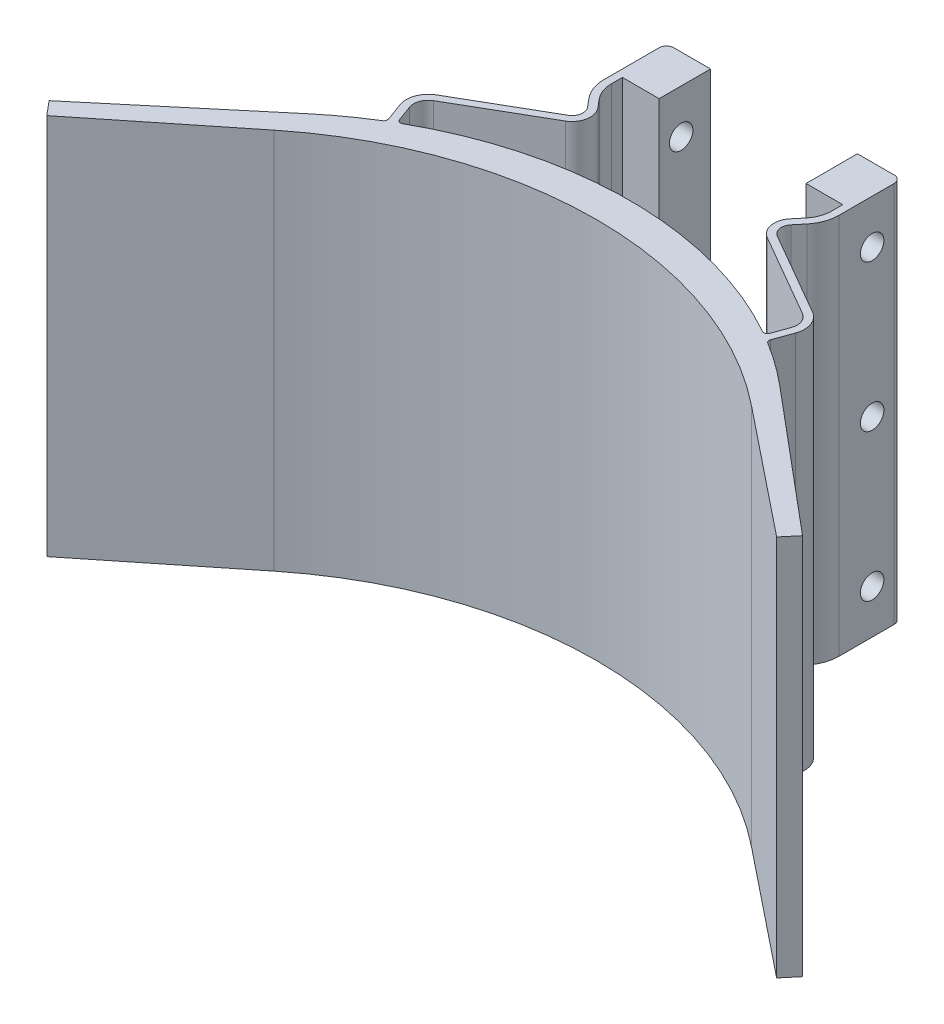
ISO-10303-21;
HEADER;
FILE_DESCRIPTION(('STEP AP214'),'2;1');
FILE_NAME('part.step','',(''),(''),'','','');
FILE_SCHEMA(('AUTOMOTIVE_DESIGN { 1 0 10303 214 1 1 1 1 }'));
ENDSEC;
DATA;
#1=APPLICATION_CONTEXT('core data for automotive mechanical design processes');
#2=APPLICATION_PROTOCOL_DEFINITION('international standard','automotive_design',2000,#1);
#3=PRODUCT_CONTEXT('',#1,'mechanical');
#4=PRODUCT('Part','Part','',(#3));
#5=PRODUCT_RELATED_PRODUCT_CATEGORY('part','',(#4));
#6=PRODUCT_DEFINITION_FORMATION('','',#4);
#7=PRODUCT_DEFINITION_CONTEXT('part definition',#1,'design');
#8=PRODUCT_DEFINITION('design','',#6,#7);
#9=PRODUCT_DEFINITION_SHAPE('','',#8);
#10=(LENGTH_UNIT() NAMED_UNIT(*) SI_UNIT(.MILLI.,.METRE.));
#11=(NAMED_UNIT(*) PLANE_ANGLE_UNIT() SI_UNIT($,.RADIAN.));
#12=(NAMED_UNIT(*) SI_UNIT($,.STERADIAN.) SOLID_ANGLE_UNIT());
#13=UNCERTAINTY_MEASURE_WITH_UNIT(LENGTH_MEASURE(1.E-05),#10,'distance_accuracy_value','');
#14=(GEOMETRIC_REPRESENTATION_CONTEXT(3) GLOBAL_UNCERTAINTY_ASSIGNED_CONTEXT((#13)) GLOBAL_UNIT_ASSIGNED_CONTEXT((#10,
#11,#12)) REPRESENTATION_CONTEXT('',''));
#15=CARTESIAN_POINT('',(0.,0.,0.));
#16=DIRECTION('',(0.,0.,1.));
#17=DIRECTION('',(1.,0.,0.));
#18=AXIS2_PLACEMENT_3D('',#15,#16,#17);
#19=CARTESIAN_POINT('',(-10.,52.,-4.));
#20=DIRECTION('',(-1.,0.,0.));
#21=DIRECTION('',(0.,0.,1.));
#22=AXIS2_PLACEMENT_3D('',#19,#20,#21);
#23=PLANE('',#22);
#24=CARTESIAN_POINT('',(-10.,6.,0.));
#25=DIRECTION('',(-1.,0.,0.));
#26=DIRECTION('',(0.,0.,1.));
#27=AXIS2_PLACEMENT_3D('',#24,#25,#26);
#28=CIRCLE('',#27,1.6);
#29=CARTESIAN_POINT('',(-10.,6.,1.59999999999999));
#30=VERTEX_POINT('',#29);
#31=EDGE_CURVE('E915',#30,#30,#28,.T.);
#32=ORIENTED_EDGE('',*,*,#31,.T.);
#33=EDGE_LOOP('',(#32));
#34=FACE_BOUND('',#33,.T.);
#35=CARTESIAN_POINT('',(-10.,26.,0.));
#36=DIRECTION('',(-1.,0.,0.));
#37=DIRECTION('',(0.,0.,1.));
#38=AXIS2_PLACEMENT_3D('',#35,#36,#37);
#39=CIRCLE('',#38,1.6);
#40=CARTESIAN_POINT('',(-10.,26.,1.60000000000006));
#41=VERTEX_POINT('',#40);
#42=EDGE_CURVE('E422',#41,#41,#39,.T.);
#43=ORIENTED_EDGE('',*,*,#42,.T.);
#44=EDGE_LOOP('',(#43));
#45=FACE_BOUND('',#44,.T.);
#46=CARTESIAN_POINT('',(-10.,46.,1.31027668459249E-13));
#47=DIRECTION('',(-1.,0.,0.));
#48=DIRECTION('',(0.,0.,1.));
#49=AXIS2_PLACEMENT_3D('',#46,#47,#48);
#50=CIRCLE('',#49,1.6);
#51=CARTESIAN_POINT('',(-10.,46.,1.60000000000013));
#52=VERTEX_POINT('',#51);
#53=EDGE_CURVE('E417',#52,#52,#50,.T.);
#54=ORIENTED_EDGE('',*,*,#53,.T.);
#55=EDGE_LOOP('',(#54));
#56=FACE_BOUND('',#55,.T.);
#57=DIRECTION('',(0.,0.,-1.));
#58=VECTOR('',#57,1.);
#59=CARTESIAN_POINT('',(-10.,0.,-4.));
#60=LINE('',#59,#58);
#61=CARTESIAN_POINT('',(-10.,0.,3.));
#62=VERTEX_POINT('',#61);
#63=CARTESIAN_POINT('',(-10.,0.,-4.));
#64=VERTEX_POINT('',#63);
#65=EDGE_CURVE('E389',#62,#64,#60,.T.);
#66=ORIENTED_EDGE('',*,*,#65,.T.);
#67=DIRECTION('',(0.,-1.,0.));
#68=VECTOR('',#67,1.);
#69=CARTESIAN_POINT('',(-10.,52.,-4.));
#70=LINE('',#69,#68);
#71=CARTESIAN_POINT('',(-10.,52.,-4.));
#72=VERTEX_POINT('',#71);
#73=EDGE_CURVE('E368',#72,#64,#70,.T.);
#74=ORIENTED_EDGE('',*,*,#73,.F.);
#75=DIRECTION('',(0.,0.,-1.));
#76=VECTOR('',#75,1.);
#77=CARTESIAN_POINT('',(-10.,52.,-4.));
#78=LINE('',#77,#76);
#79=CARTESIAN_POINT('',(-10.,52.,3.));
#80=VERTEX_POINT('',#79);
#81=EDGE_CURVE('E376',#80,#72,#78,.T.);
#82=ORIENTED_EDGE('',*,*,#81,.F.);
#83=DIRECTION('',(0.,-1.,0.));
#84=VECTOR('',#83,1.);
#85=CARTESIAN_POINT('',(-10.,52.,3.));
#86=LINE('',#85,#84);
#87=EDGE_CURVE('E597',#80,#62,#86,.T.);
#88=ORIENTED_EDGE('',*,*,#87,.T.);
#89=EDGE_LOOP('',(#66,#74,#82,#88));
#90=FACE_BOUND('',#89,.T.);
#91=ADVANCED_FACE('F45',(#34,#45,#56,#90),#23,.F.);
#92=CARTESIAN_POINT('',(-10.,52.,-4.));
#93=DIRECTION('',(0.,0.,1.));
#94=DIRECTION('',(1.,0.,0.));
#95=AXIS2_PLACEMENT_3D('',#92,#93,#94);
#96=PLANE('',#95);
#97=DIRECTION('',(-1.,0.,0.));
#98=VECTOR('',#97,1.);
#99=CARTESIAN_POINT('',(-10.,0.,-4.));
#100=LINE('',#99,#98);
#101=CARTESIAN_POINT('',(-15.,0.,-4.));
#102=VERTEX_POINT('',#101);
#103=EDGE_CURVE('E914',#64,#102,#100,.T.);
#104=ORIENTED_EDGE('',*,*,#103,.T.);
#105=DIRECTION('',(0.,-1.,0.));
#106=VECTOR('',#105,1.);
#107=CARTESIAN_POINT('',(-15.,52.,-4.));
#108=LINE('',#107,#106);
#109=CARTESIAN_POINT('',(-15.,52.,-4.));
#110=VERTEX_POINT('',#109);
#111=EDGE_CURVE('E371',#102,#110,#108,.F.);
#112=ORIENTED_EDGE('',*,*,#111,.T.);
#113=DIRECTION('',(-1.,0.,0.));
#114=VECTOR('',#113,1.);
#115=CARTESIAN_POINT('',(-10.,52.,-4.));
#116=LINE('',#115,#114);
#117=EDGE_CURVE('E363',#72,#110,#116,.T.);
#118=ORIENTED_EDGE('',*,*,#117,.F.);
#119=ORIENTED_EDGE('',*,*,#73,.T.);
#120=EDGE_LOOP('',(#104,#112,#118,#119));
#121=FACE_BOUND('',#120,.T.);
#122=ADVANCED_FACE('F366',(#121),#96,.F.);
#123=CARTESIAN_POINT('',(-16.,52.,-4.));
#124=DIRECTION('',(1.,0.,0.));
#125=DIRECTION('',(0.,0.,-1.));
#126=AXIS2_PLACEMENT_3D('',#123,#124,#125);
#127=PLANE('',#126);
#128=CARTESIAN_POINT('',(-16.,6.,0.));
#129=DIRECTION('',(1.,0.,0.));
#130=DIRECTION('',(0.,0.,-1.));
#131=AXIS2_PLACEMENT_3D('',#128,#129,#130);
#132=CIRCLE('',#131,1.6);
#133=CARTESIAN_POINT('',(-16.,6.,-1.60000000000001));
#134=VERTEX_POINT('',#133);
#135=EDGE_CURVE('E421',#134,#134,#132,.T.);
#136=ORIENTED_EDGE('',*,*,#135,.T.);
#137=EDGE_LOOP('',(#136));
#138=FACE_BOUND('',#137,.T.);
#139=CARTESIAN_POINT('',(-16.,26.,0.));
#140=DIRECTION('',(1.,0.,0.));
#141=DIRECTION('',(0.,0.,-1.));
#142=AXIS2_PLACEMENT_3D('',#139,#140,#141);
#143=CIRCLE('',#142,1.6);
#144=CARTESIAN_POINT('',(-16.,26.,-1.59999999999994));
#145=VERTEX_POINT('',#144);
#146=EDGE_CURVE('E416',#145,#145,#143,.T.);
#147=ORIENTED_EDGE('',*,*,#146,.T.);
#148=EDGE_LOOP('',(#147));
#149=FACE_BOUND('',#148,.T.);
#150=CARTESIAN_POINT('',(-16.,46.,1.26129625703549E-13));
#151=DIRECTION('',(1.,0.,0.));
#152=DIRECTION('',(0.,0.,-1.));
#153=AXIS2_PLACEMENT_3D('',#150,#151,#152);
#154=CIRCLE('',#153,1.6);
#155=CARTESIAN_POINT('',(-16.,46.,-1.59999999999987));
#156=VERTEX_POINT('',#155);
#157=EDGE_CURVE('E410',#156,#156,#154,.T.);
#158=ORIENTED_EDGE('',*,*,#157,.T.);
#159=EDGE_LOOP('',(#158));
#160=FACE_BOUND('',#159,.T.);
#161=DIRECTION('',(0.,0.,1.));
#162=VECTOR('',#161,1.);
#163=CARTESIAN_POINT('',(-16.,52.,-4.));
#164=LINE('',#163,#162);
#165=CARTESIAN_POINT('',(-16.,52.,-2.99999999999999));
#166=VERTEX_POINT('',#165);
#167=CARTESIAN_POINT('',(-15.9999999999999,52.,4.50000000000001));
#168=VERTEX_POINT('',#167);
#169=EDGE_CURVE('E375',#166,#168,#164,.T.);
#170=ORIENTED_EDGE('',*,*,#169,.F.);
#171=DIRECTION('',(0.,-1.,0.));
#172=VECTOR('',#171,1.);
#173=CARTESIAN_POINT('',(-16.,52.,-2.99999999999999));
#174=LINE('',#173,#172);
#175=CARTESIAN_POINT('',(-16.,0.,-2.99999999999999));
#176=VERTEX_POINT('',#175);
#177=EDGE_CURVE('E391',#166,#176,#174,.T.);
#178=ORIENTED_EDGE('',*,*,#177,.T.);
#179=DIRECTION('',(0.,0.,1.));
#180=VECTOR('',#179,1.);
#181=CARTESIAN_POINT('',(-16.,0.,-4.));
#182=LINE('',#181,#180);
#183=CARTESIAN_POINT('',(-15.9999999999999,0.,4.50000000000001));
#184=VERTEX_POINT('',#183);
#185=EDGE_CURVE('E530',#176,#184,#182,.T.);
#186=ORIENTED_EDGE('',*,*,#185,.T.);
#187=DIRECTION('',(0.,-1.,0.));
#188=VECTOR('',#187,1.);
#189=CARTESIAN_POINT('',(-15.9999999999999,52.,4.50000000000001));
#190=LINE('',#189,#188);
#191=EDGE_CURVE('E392',#168,#184,#190,.T.);
#192=ORIENTED_EDGE('',*,*,#191,.F.);
#193=EDGE_LOOP('',(#170,#178,#186,#192));
#194=FACE_BOUND('',#193,.T.);
#195=ADVANCED_FACE('F936',(#138,#149,#160,#194),#127,.F.);
#196=CARTESIAN_POINT('',(-10.9755045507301,52.,4.5));
#197=DIRECTION('',(0.,-1.,0.));
#198=DIRECTION('',(0.,0.,-1.));
#199=AXIS2_PLACEMENT_3D('',#196,#197,#198);
#200=CYLINDRICAL_SURFACE('',#199,5.0244954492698);
#201=CARTESIAN_POINT('',(-10.9755045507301,0.,4.5));
#202=DIRECTION('',(0.,1.,0.));
#203=DIRECTION('',(0.,0.,1.));
#204=AXIS2_PLACEMENT_3D('',#201,#202,#203);
#205=CIRCLE('',#204,5.0244954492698);
#206=CARTESIAN_POINT('',(-14.8381802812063,0.,7.71329904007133));
#207=VERTEX_POINT('',#206);
#208=EDGE_CURVE('E527',#184,#207,#205,.T.);
#209=ORIENTED_EDGE('',*,*,#208,.T.);
#210=DIRECTION('',(0.,-1.,0.));
#211=VECTOR('',#210,1.);
#212=CARTESIAN_POINT('',(-14.8381802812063,52.,7.71329904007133));
#213=LINE('',#212,#211);
#214=CARTESIAN_POINT('',(-14.8381802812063,52.,7.71329904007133));
#215=VERTEX_POINT('',#214);
#216=EDGE_CURVE('E402',#215,#207,#213,.T.);
#217=ORIENTED_EDGE('',*,*,#216,.F.);
#218=CARTESIAN_POINT('',(-10.9755045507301,52.,4.5));
#219=DIRECTION('',(0.,1.,0.));
#220=DIRECTION('',(0.,0.,1.));
#221=AXIS2_PLACEMENT_3D('',#218,#219,#220);
#222=CIRCLE('',#221,5.0244954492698);
#223=EDGE_CURVE('E630',#168,#215,#222,.T.);
#224=ORIENTED_EDGE('',*,*,#223,.F.);
#225=ORIENTED_EDGE('',*,*,#191,.T.);
#226=EDGE_LOOP('',(#209,#217,#224,#225));
#227=FACE_BOUND('',#226,.T.);
#228=ADVANCED_FACE('F931',(#227),#200,.T.);
#229=CARTESIAN_POINT('',(-14.8381802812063,52.,7.71329904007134));
#230=DIRECTION('',(0.768768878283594,0.,-0.639526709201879));
#231=DIRECTION('',(-0.639526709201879,0.,-0.768768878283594));
#232=AXIS2_PLACEMENT_3D('',#229,#230,#231);
#233=PLANE('',#232);
#234=DIRECTION('',(0.639526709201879,0.,0.768768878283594));
#235=VECTOR('',#234,1.);
#236=CARTESIAN_POINT('',(-14.8381802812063,0.,7.71329904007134));
#237=LINE('',#236,#235);
#238=CARTESIAN_POINT('',(-13.8468466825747,0.,8.90497158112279));
#239=VERTEX_POINT('',#238);
#240=EDGE_CURVE('E529',#207,#239,#237,.T.);
#241=ORIENTED_EDGE('',*,*,#240,.T.);
#242=DIRECTION('',(0.,-1.,0.));
#243=VECTOR('',#242,1.);
#244=CARTESIAN_POINT('',(-13.8468466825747,52.,8.90497158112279));
#245=LINE('',#244,#243);
#246=CARTESIAN_POINT('',(-13.8468466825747,52.,8.90497158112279));
#247=VERTEX_POINT('',#246);
#248=EDGE_CURVE('E565',#247,#239,#245,.T.);
#249=ORIENTED_EDGE('',*,*,#248,.F.);
#250=DIRECTION('',(0.639526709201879,0.,0.768768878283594));
#251=VECTOR('',#250,1.);
#252=CARTESIAN_POINT('',(-14.8381802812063,52.,7.71329904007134));
#253=LINE('',#252,#251);
#254=EDGE_CURVE('E632',#215,#247,#253,.T.);
#255=ORIENTED_EDGE('',*,*,#254,.F.);
#256=ORIENTED_EDGE('',*,*,#216,.T.);
#257=EDGE_LOOP('',(#241,#249,#255,#256));
#258=FACE_BOUND('',#257,.T.);
#259=ADVANCED_FACE('F927',(#258),#233,.F.);
#260=CARTESIAN_POINT('',(-15.0000000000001,52.,9.86426164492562));
#261=DIRECTION('',(0.,-1.,0.));
#262=DIRECTION('',(0.,0.,-1.));
#263=AXIS2_PLACEMENT_3D('',#260,#261,#262);
#264=CYLINDRICAL_SURFACE('',#263,1.50000000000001);
#265=CARTESIAN_POINT('',(-15.0000000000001,0.,9.86426164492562));
#266=DIRECTION('',(0.,-1.,0.));
#267=DIRECTION('',(0.,0.,-1.));
#268=AXIS2_PLACEMENT_3D('',#265,#266,#267);
#269=CIRCLE('',#268,1.50000000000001);
#270=CARTESIAN_POINT('',(-14.2500000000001,0.,11.1632997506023));
#271=VERTEX_POINT('',#270);
#272=EDGE_CURVE('E628',#239,#271,#269,.T.);
#273=ORIENTED_EDGE('',*,*,#272,.T.);
#274=DIRECTION('',(0.,-1.,0.));
#275=VECTOR('',#274,1.);
#276=CARTESIAN_POINT('',(-14.2500000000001,52.,11.1632997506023));
#277=LINE('',#276,#275);
#278=CARTESIAN_POINT('',(-14.2500000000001,52.,11.1632997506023));
#279=VERTEX_POINT('',#278);
#280=EDGE_CURVE('E568',#279,#271,#277,.T.);
#281=ORIENTED_EDGE('',*,*,#280,.F.);
#282=CARTESIAN_POINT('',(-15.0000000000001,52.,9.86426164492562));
#283=DIRECTION('',(0.,-1.,0.));
#284=DIRECTION('',(0.,0.,-1.));
#285=AXIS2_PLACEMENT_3D('',#282,#283,#284);
#286=CIRCLE('',#285,1.50000000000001);
#287=EDGE_CURVE('E924',#247,#279,#286,.T.);
#288=ORIENTED_EDGE('',*,*,#287,.F.);
#289=ORIENTED_EDGE('',*,*,#248,.T.);
#290=EDGE_LOOP('',(#273,#281,#288,#289));
#291=FACE_BOUND('',#290,.T.);
#292=ADVANCED_FACE('F922',(#291),#264,.F.);
#293=CARTESIAN_POINT('',(-25.6028720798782,52.,17.7178835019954));
#294=DIRECTION('',(0.500000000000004,0.,0.866025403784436));
#295=DIRECTION('',(0.866025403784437,0.,-0.500000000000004));
#296=AXIS2_PLACEMENT_3D('',#293,#294,#295);
#297=PLANE('',#296);
#298=DIRECTION('',(-0.866025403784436,0.,0.500000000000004));
#299=VECTOR('',#298,1.);
#300=CARTESIAN_POINT('',(-25.6028720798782,0.,17.7178835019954));
#301=LINE('',#300,#299);
#302=CARTESIAN_POINT('',(-25.6028720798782,0.,17.7178835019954));
#303=VERTEX_POINT('',#302);
#304=EDGE_CURVE('E625',#271,#303,#301,.T.);
#305=ORIENTED_EDGE('',*,*,#304,.T.);
#306=DIRECTION('',(0.,-1.,0.));
#307=VECTOR('',#306,1.);
#308=CARTESIAN_POINT('',(-25.6028720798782,52.,17.7178835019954));
#309=LINE('',#308,#307);
#310=CARTESIAN_POINT('',(-25.6028720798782,52.,17.7178835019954));
#311=VERTEX_POINT('',#310);
#312=EDGE_CURVE('E662',#311,#303,#309,.T.);
#313=ORIENTED_EDGE('',*,*,#312,.F.);
#314=DIRECTION('',(-0.866025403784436,0.,0.500000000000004));
#315=VECTOR('',#314,1.);
#316=CARTESIAN_POINT('',(-25.6028720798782,52.,17.7178835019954));
#317=LINE('',#316,#315);
#318=EDGE_CURVE('E678',#279,#311,#317,.T.);
#319=ORIENTED_EDGE('',*,*,#318,.F.);
#320=ORIENTED_EDGE('',*,*,#280,.T.);
#321=EDGE_LOOP('',(#305,#313,#319,#320));
#322=FACE_BOUND('',#321,.T.);
#323=ADVANCED_FACE('F676',(#322),#297,.F.);
#324=CARTESIAN_POINT('',(-24.1028720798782,52.,20.3159597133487));
#325=DIRECTION('',(0.,-1.,0.));
#326=DIRECTION('',(0.,0.,-1.));
#327=AXIS2_PLACEMENT_3D('',#324,#325,#326);
#328=CYLINDRICAL_SURFACE('',#327,3.);
#329=CARTESIAN_POINT('',(-24.1028720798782,0.,20.3159597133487));
#330=DIRECTION('',(0.,1.,0.));
#331=DIRECTION('',(0.,0.,-1.));
#332=AXIS2_PLACEMENT_3D('',#329,#330,#331);
#333=CIRCLE('',#332,3.);
#334=CARTESIAN_POINT('',(-26.921949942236,0.,21.3420201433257));
#335=VERTEX_POINT('',#334);
#336=EDGE_CURVE('E627',#303,#335,#333,.T.);
#337=ORIENTED_EDGE('',*,*,#336,.T.);
#338=DIRECTION('',(0.,-1.,0.));
#339=VECTOR('',#338,1.);
#340=CARTESIAN_POINT('',(-26.921949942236,52.,21.3420201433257));
#341=LINE('',#340,#339);
#342=CARTESIAN_POINT('',(-26.921949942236,52.,21.3420201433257));
#343=VERTEX_POINT('',#342);
#344=EDGE_CURVE('E654',#343,#335,#341,.T.);
#345=ORIENTED_EDGE('',*,*,#344,.F.);
#346=CARTESIAN_POINT('',(-24.1028720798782,52.,20.3159597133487));
#347=DIRECTION('',(0.,1.,0.));
#348=DIRECTION('',(0.,0.,-1.));
#349=AXIS2_PLACEMENT_3D('',#346,#347,#348);
#350=CIRCLE('',#349,3.);
#351=EDGE_CURVE('E1670',#311,#343,#350,.T.);
#352=ORIENTED_EDGE('',*,*,#351,.F.);
#353=ORIENTED_EDGE('',*,*,#312,.T.);
#354=EDGE_LOOP('',(#337,#345,#352,#353));
#355=FACE_BOUND('',#354,.T.);
#356=ADVANCED_FACE('F1232',(#355),#328,.T.);
#357=CARTESIAN_POINT('',(-26.921949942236,52.,21.3420201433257));
#358=DIRECTION('',(0.93969262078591,0.,-0.342020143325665));
#359=DIRECTION('',(-0.342020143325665,0.,-0.93969262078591));
#360=AXIS2_PLACEMENT_3D('',#357,#358,#359);
#361=PLANE('',#360);
#362=DIRECTION('',(0.342020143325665,0.,0.93969262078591));
#363=VECTOR('',#362,1.);
#364=CARTESIAN_POINT('',(-26.921949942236,0.,21.3420201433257));
#365=LINE('',#364,#363);
#366=CARTESIAN_POINT('',(-26.0157620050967,0.,23.831751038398));
#367=VERTEX_POINT('',#366);
#368=EDGE_CURVE('E688',#335,#367,#365,.T.);
#369=ORIENTED_EDGE('',*,*,#368,.T.);
#370=DIRECTION('',(0.,1.,0.));
#371=VECTOR('',#370,1.);
#372=CARTESIAN_POINT('',(-26.0157620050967,52.,23.831751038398));
#373=LINE('',#372,#371);
#374=CARTESIAN_POINT('',(-26.0157620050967,52.,23.831751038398));
#375=VERTEX_POINT('',#374);
#376=EDGE_CURVE('E448',#367,#375,#373,.T.);
#377=ORIENTED_EDGE('',*,*,#376,.T.);
#378=DIRECTION('',(0.342020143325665,0.,0.93969262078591));
#379=VECTOR('',#378,1.);
#380=CARTESIAN_POINT('',(-26.921949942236,52.,21.3420201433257));
#381=LINE('',#380,#379);
#382=EDGE_CURVE('E1641',#343,#375,#381,.T.);
#383=ORIENTED_EDGE('',*,*,#382,.F.);
#384=ORIENTED_EDGE('',*,*,#344,.T.);
#385=EDGE_LOOP('',(#369,#377,#383,#384));
#386=FACE_BOUND('',#385,.T.);
#387=ADVANCED_FACE('F1220',(#386),#361,.F.);
#388=CARTESIAN_POINT('',(0.,52.,67.));
#389=DIRECTION('',(0.,-1.,0.));
#390=DIRECTION('',(0.,0.,-1.));
#391=AXIS2_PLACEMENT_3D('',#388,#389,#390);
#392=CYLINDRICAL_SURFACE('',#391,50.0000000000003);
#393=CARTESIAN_POINT('',(0.,52.,67.));
#394=DIRECTION('',(0.,1.,0.));
#395=DIRECTION('',(0.,0.,1.));
#396=AXIS2_PLACEMENT_3D('',#393,#394,#395);
#397=CIRCLE('',#396,50.0000000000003);
#398=CARTESIAN_POINT('',(-26.2233745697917,52.,24.4284763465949));
#399=VERTEX_POINT('',#398);
#400=CARTESIAN_POINT('',(-32.139380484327,52.,28.6977778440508));
#401=VERTEX_POINT('',#400);
#402=EDGE_CURVE('E1638',#399,#401,#397,.T.);
#403=ORIENTED_EDGE('',*,*,#402,.F.);
#404=DIRECTION('',(0.,-1.,0.));
#405=VECTOR('',#404,1.);
#406=CARTESIAN_POINT('',(-26.2233745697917,52.,24.4284763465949));
#407=LINE('',#406,#405);
#408=CARTESIAN_POINT('',(-26.2233745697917,0.,24.4284763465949));
#409=VERTEX_POINT('',#408);
#410=EDGE_CURVE('E444',#399,#409,#407,.T.);
#411=ORIENTED_EDGE('',*,*,#410,.T.);
#412=CARTESIAN_POINT('',(0.,0.,67.));
#413=DIRECTION('',(0.,1.,0.));
#414=DIRECTION('',(0.,0.,1.));
#415=AXIS2_PLACEMENT_3D('',#412,#413,#414);
#416=CIRCLE('',#415,50.0000000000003);
#417=CARTESIAN_POINT('',(-32.139380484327,0.,28.6977778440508));
#418=VERTEX_POINT('',#417);
#419=EDGE_CURVE('E525',#409,#418,#416,.T.);
#420=ORIENTED_EDGE('',*,*,#419,.T.);
#421=DIRECTION('',(0.,-1.,0.));
#422=VECTOR('',#421,1.);
#423=CARTESIAN_POINT('',(-32.139380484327,52.,28.6977778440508));
#424=LINE('',#423,#422);
#425=EDGE_CURVE('E592',#401,#418,#424,.T.);
#426=ORIENTED_EDGE('',*,*,#425,.F.);
#427=EDGE_LOOP('',(#403,#411,#420,#426));
#428=FACE_BOUND('',#427,.T.);
#429=ADVANCED_FACE('F1214',(#428),#392,.T.);
#430=CARTESIAN_POINT('',(-32.139380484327,52.,28.6977778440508));
#431=DIRECTION('',(0.642787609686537,0.,0.76604444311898));
#432=DIRECTION('',(0.76604444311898,0.,-0.642787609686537));
#433=AXIS2_PLACEMENT_3D('',#430,#431,#432);
#434=PLANE('',#433);
#435=DIRECTION('',(-0.76604444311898,0.,0.642787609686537));
#436=VECTOR('',#435,1.);
#437=CARTESIAN_POINT('',(-32.139380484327,0.,28.6977778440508));
#438=LINE('',#437,#436);
#439=CARTESIAN_POINT('',(-51.2904915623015,0.,44.7674680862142));
#440=VERTEX_POINT('',#439);
#441=EDGE_CURVE('E522',#418,#440,#438,.T.);
#442=ORIENTED_EDGE('',*,*,#441,.T.);
#443=DIRECTION('',(0.,-1.,0.));
#444=VECTOR('',#443,1.);
#445=CARTESIAN_POINT('',(-51.2904915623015,52.,44.7674680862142));
#446=LINE('',#445,#444);
#447=CARTESIAN_POINT('',(-51.2904915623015,52.,44.7674680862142));
#448=VERTEX_POINT('',#447);
#449=EDGE_CURVE('E589',#448,#440,#446,.T.);
#450=ORIENTED_EDGE('',*,*,#449,.F.);
#451=DIRECTION('',(-0.76604444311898,0.,0.642787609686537));
#452=VECTOR('',#451,1.);
#453=CARTESIAN_POINT('',(-32.139380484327,52.,28.6977778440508));
#454=LINE('',#453,#452);
#455=EDGE_CURVE('E623',#401,#448,#454,.T.);
#456=ORIENTED_EDGE('',*,*,#455,.F.);
#457=ORIENTED_EDGE('',*,*,#425,.T.);
#458=EDGE_LOOP('',(#442,#450,#456,#457));
#459=FACE_BOUND('',#458,.T.);
#460=ADVANCED_FACE('F1219',(#459),#434,.F.);
#461=CARTESIAN_POINT('',(-51.2904915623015,52.,44.7674680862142));
#462=DIRECTION('',(0.766044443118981,0.,-0.642787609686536));
#463=DIRECTION('',(-0.642787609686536,0.,-0.766044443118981));
#464=AXIS2_PLACEMENT_3D('',#461,#462,#463);
#465=PLANE('',#464);
#466=DIRECTION('',(0.642787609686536,0.,0.766044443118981));
#467=VECTOR('',#466,1.);
#468=CARTESIAN_POINT('',(-51.2904915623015,0.,44.7674680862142));
#469=LINE('',#468,#467);
#470=CARTESIAN_POINT('',(-49.6835225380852,0.,46.6825791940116));
#471=VERTEX_POINT('',#470);
#472=EDGE_CURVE('E524',#440,#471,#469,.T.);
#473=ORIENTED_EDGE('',*,*,#472,.T.);
#474=DIRECTION('',(0.,-1.,0.));
#475=VECTOR('',#474,1.);
#476=CARTESIAN_POINT('',(-49.6835225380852,52.,46.6825791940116));
#477=LINE('',#476,#475);
#478=CARTESIAN_POINT('',(-49.6835225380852,52.,46.6825791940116));
#479=VERTEX_POINT('',#478);
#480=EDGE_CURVE('E593',#479,#471,#477,.T.);
#481=ORIENTED_EDGE('',*,*,#480,.F.);
#482=DIRECTION('',(0.642787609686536,0.,0.766044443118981));
#483=VECTOR('',#482,1.);
#484=CARTESIAN_POINT('',(-51.2904915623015,52.,44.7674680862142));
#485=LINE('',#484,#483);
#486=EDGE_CURVE('E620',#448,#479,#485,.T.);
#487=ORIENTED_EDGE('',*,*,#486,.F.);
#488=ORIENTED_EDGE('',*,*,#449,.T.);
#489=EDGE_LOOP('',(#473,#481,#487,#488));
#490=FACE_BOUND('',#489,.T.);
#491=ADVANCED_FACE('F1523',(#490),#465,.F.);
#492=CARTESIAN_POINT('',(-49.6835225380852,52.,46.6825791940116));
#493=DIRECTION('',(-0.624999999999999,0.,-0.780624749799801));
#494=DIRECTION('',(-0.780624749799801,0.,0.624999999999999));
#495=AXIS2_PLACEMENT_3D('',#492,#493,#494);
#496=PLANE('',#495);
#497=DIRECTION('',(0.780624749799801,0.,-0.624999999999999));
#498=VECTOR('',#497,1.);
#499=CARTESIAN_POINT('',(-49.6835225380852,0.,46.6825791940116));
#500=LINE('',#499,#498);
#501=CARTESIAN_POINT('',(-32.4999999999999,0.,32.9247504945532));
#502=VERTEX_POINT('',#501);
#503=EDGE_CURVE('E520',#471,#502,#500,.T.);
#504=ORIENTED_EDGE('',*,*,#503,.T.);
#505=DIRECTION('',(0.,-1.,0.));
#506=VECTOR('',#505,1.);
#507=CARTESIAN_POINT('',(-32.4999999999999,52.,32.9247504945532));
#508=LINE('',#507,#506);
#509=CARTESIAN_POINT('',(-32.4999999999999,52.,32.9247504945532));
#510=VERTEX_POINT('',#509);
#511=EDGE_CURVE('E822',#510,#502,#508,.T.);
#512=ORIENTED_EDGE('',*,*,#511,.F.);
#513=DIRECTION('',(0.780624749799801,0.,-0.624999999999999));
#514=VECTOR('',#513,1.);
#515=CARTESIAN_POINT('',(-49.6835225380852,52.,46.6825791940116));
#516=LINE('',#515,#514);
#517=EDGE_CURVE('E622',#479,#510,#516,.T.);
#518=ORIENTED_EDGE('',*,*,#517,.F.);
#519=ORIENTED_EDGE('',*,*,#480,.T.);
#520=EDGE_LOOP('',(#504,#512,#518,#519));
#521=FACE_BOUND('',#520,.T.);
#522=ADVANCED_FACE('F832',(#521),#496,.F.);
#523=CARTESIAN_POINT('',(0.,52.,73.5172374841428));
#524=DIRECTION('',(0.,-1.,0.));
#525=DIRECTION('',(0.,0.,-1.));
#526=AXIS2_PLACEMENT_3D('',#523,#524,#525);
#527=CYLINDRICAL_SURFACE('',#526,52.);
#528=CARTESIAN_POINT('',(0.,0.,73.5172374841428));
#529=DIRECTION('',(0.,-1.,0.));
#530=DIRECTION('',(0.,0.,-1.));
#531=AXIS2_PLACEMENT_3D('',#528,#529,#530);
#532=CIRCLE('',#531,52.);
#533=CARTESIAN_POINT('',(32.5000000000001,0.,32.9247504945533));
#534=VERTEX_POINT('',#533);
#535=EDGE_CURVE('E517',#502,#534,#532,.T.);
#536=ORIENTED_EDGE('',*,*,#535,.T.);
#537=DIRECTION('',(0.,-1.,0.));
#538=VECTOR('',#537,1.);
#539=CARTESIAN_POINT('',(32.5000000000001,52.,32.9247504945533));
#540=LINE('',#539,#538);
#541=CARTESIAN_POINT('',(32.5000000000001,52.,32.9247504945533));
#542=VERTEX_POINT('',#541);
#543=EDGE_CURVE('E818',#542,#534,#540,.T.);
#544=ORIENTED_EDGE('',*,*,#543,.F.);
#545=CARTESIAN_POINT('',(0.,52.,73.5172374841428));
#546=DIRECTION('',(0.,-1.,0.));
#547=DIRECTION('',(0.,0.,-1.));
#548=AXIS2_PLACEMENT_3D('',#545,#546,#547);
#549=CIRCLE('',#548,52.);
#550=EDGE_CURVE('E851',#510,#542,#549,.T.);
#551=ORIENTED_EDGE('',*,*,#550,.F.);
#552=ORIENTED_EDGE('',*,*,#511,.T.);
#553=EDGE_LOOP('',(#536,#544,#551,#552));
#554=FACE_BOUND('',#553,.T.);
#555=ADVANCED_FACE('F842',(#554),#527,.F.);
#556=CARTESIAN_POINT('',(49.6835225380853,52.,46.6825791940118));
#557=DIRECTION('',(0.625000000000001,0.,-0.780624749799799));
#558=DIRECTION('',(-0.780624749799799,0.,-0.625000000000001));
#559=AXIS2_PLACEMENT_3D('',#556,#557,#558);
#560=PLANE('',#559);
#561=DIRECTION('',(0.780624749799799,0.,0.625000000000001));
#562=VECTOR('',#561,1.);
#563=CARTESIAN_POINT('',(49.6835225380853,0.,46.6825791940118));
#564=LINE('',#563,#562);
#565=CARTESIAN_POINT('',(49.6835225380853,0.,46.6825791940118));
#566=VERTEX_POINT('',#565);
#567=EDGE_CURVE('E519',#534,#566,#564,.T.);
#568=ORIENTED_EDGE('',*,*,#567,.T.);
#569=DIRECTION('',(0.,-1.,0.));
#570=VECTOR('',#569,1.);
#571=CARTESIAN_POINT('',(49.6835225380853,52.,46.6825791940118));
#572=LINE('',#571,#570);
#573=CARTESIAN_POINT('',(49.6835225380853,52.,46.6825791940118));
#574=VERTEX_POINT('',#573);
#575=EDGE_CURVE('E618',#574,#566,#572,.T.);
#576=ORIENTED_EDGE('',*,*,#575,.F.);
#577=DIRECTION('',(0.780624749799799,0.,0.625000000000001));
#578=VECTOR('',#577,1.);
#579=CARTESIAN_POINT('',(49.6835225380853,52.,46.6825791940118));
#580=LINE('',#579,#578);
#581=EDGE_CURVE('E848',#542,#574,#580,.T.);
#582=ORIENTED_EDGE('',*,*,#581,.F.);
#583=ORIENTED_EDGE('',*,*,#543,.T.);
#584=EDGE_LOOP('',(#568,#576,#582,#583));
#585=FACE_BOUND('',#584,.T.);
#586=ADVANCED_FACE('F846',(#585),#560,.F.);
#587=CARTESIAN_POINT('',(51.2904915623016,52.,44.7674680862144));
#588=DIRECTION('',(-0.766044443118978,0.,-0.642787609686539));
#589=DIRECTION('',(-0.642787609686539,0.,0.766044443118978));
#590=AXIS2_PLACEMENT_3D('',#587,#588,#589);
#591=PLANE('',#590);
#592=DIRECTION('',(0.642787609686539,0.,-0.766044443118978));
#593=VECTOR('',#592,1.);
#594=CARTESIAN_POINT('',(51.2904915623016,0.,44.7674680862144));
#595=LINE('',#594,#593);
#596=CARTESIAN_POINT('',(51.2904915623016,0.,44.7674680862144));
#597=VERTEX_POINT('',#596);
#598=EDGE_CURVE('E651',#566,#597,#595,.T.);
#599=ORIENTED_EDGE('',*,*,#598,.T.);
#600=DIRECTION('',(0.,-1.,0.));
#601=VECTOR('',#600,1.);
#602=CARTESIAN_POINT('',(51.2904915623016,52.,44.7674680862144));
#603=LINE('',#602,#601);
#604=CARTESIAN_POINT('',(51.2904915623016,52.,44.7674680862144));
#605=VERTEX_POINT('',#604);
#606=EDGE_CURVE('E561',#605,#597,#603,.T.);
#607=ORIENTED_EDGE('',*,*,#606,.F.);
#608=DIRECTION('',(0.642787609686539,0.,-0.766044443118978));
#609=VECTOR('',#608,1.);
#610=CARTESIAN_POINT('',(51.2904915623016,52.,44.7674680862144));
#611=LINE('',#610,#609);
#612=EDGE_CURVE('E515',#574,#605,#611,.T.);
#613=ORIENTED_EDGE('',*,*,#612,.F.);
#614=ORIENTED_EDGE('',*,*,#575,.T.);
#615=EDGE_LOOP('',(#599,#607,#613,#614));
#616=FACE_BOUND('',#615,.T.);
#617=ADVANCED_FACE('F1090',(#616),#591,.F.);
#618=CARTESIAN_POINT('',(32.1393804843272,52.,28.6977778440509));
#619=DIRECTION('',(-0.642787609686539,0.,0.766044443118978));
#620=DIRECTION('',(0.766044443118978,0.,0.642787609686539));
#621=AXIS2_PLACEMENT_3D('',#618,#619,#620);
#622=PLANE('',#621);
#623=DIRECTION('',(-0.766044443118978,0.,-0.642787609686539));
#624=VECTOR('',#623,1.);
#625=CARTESIAN_POINT('',(32.1393804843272,0.,28.6977778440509));
#626=LINE('',#625,#624);
#627=CARTESIAN_POINT('',(32.1393804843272,0.,28.6977778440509));
#628=VERTEX_POINT('',#627);
#629=EDGE_CURVE('E614',#597,#628,#626,.T.);
#630=ORIENTED_EDGE('',*,*,#629,.T.);
#631=DIRECTION('',(0.,-1.,0.));
#632=VECTOR('',#631,1.);
#633=CARTESIAN_POINT('',(32.1393804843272,52.,28.6977778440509));
#634=LINE('',#633,#632);
#635=CARTESIAN_POINT('',(32.1393804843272,52.,28.6977778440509));
#636=VERTEX_POINT('',#635);
#637=EDGE_CURVE('E559',#636,#628,#634,.T.);
#638=ORIENTED_EDGE('',*,*,#637,.F.);
#639=DIRECTION('',(-0.766044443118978,0.,-0.642787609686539));
#640=VECTOR('',#639,1.);
#641=CARTESIAN_POINT('',(32.1393804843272,52.,28.6977778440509));
#642=LINE('',#641,#640);
#643=EDGE_CURVE('E512',#605,#636,#642,.T.);
#644=ORIENTED_EDGE('',*,*,#643,.F.);
#645=ORIENTED_EDGE('',*,*,#606,.T.);
#646=EDGE_LOOP('',(#630,#638,#644,#645));
#647=FACE_BOUND('',#646,.T.);
#648=ADVANCED_FACE('F1087',(#647),#622,.F.);
#649=CARTESIAN_POINT('',(0.,52.,67.));
#650=DIRECTION('',(0.,-1.,0.));
#651=DIRECTION('',(0.,0.,-1.));
#652=AXIS2_PLACEMENT_3D('',#649,#650,#651);
#653=CYLINDRICAL_SURFACE('',#652,50.0000000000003);
#654=CARTESIAN_POINT('',(0.,0.,67.));
#655=DIRECTION('',(0.,1.,0.));
#656=DIRECTION('',(0.,0.,-1.));
#657=AXIS2_PLACEMENT_3D('',#654,#655,#656);
#658=CIRCLE('',#657,50.0000000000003);
#659=CARTESIAN_POINT('',(26.2233745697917,0.,24.4284763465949));
#660=VERTEX_POINT('',#659);
#661=EDGE_CURVE('E611',#628,#660,#658,.T.);
#662=ORIENTED_EDGE('',*,*,#661,.T.);
#663=DIRECTION('',(0.,-1.,0.));
#664=VECTOR('',#663,1.);
#665=CARTESIAN_POINT('',(26.2233745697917,52.,24.4284763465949));
#666=LINE('',#665,#664);
#667=CARTESIAN_POINT('',(26.2233745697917,52.,24.4284763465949));
#668=VERTEX_POINT('',#667);
#669=EDGE_CURVE('E61',#660,#668,#666,.F.);
#670=ORIENTED_EDGE('',*,*,#669,.T.);
#671=CARTESIAN_POINT('',(0.,52.,67.));
#672=DIRECTION('',(0.,1.,0.));
#673=DIRECTION('',(0.,0.,-1.));
#674=AXIS2_PLACEMENT_3D('',#671,#672,#673);
#675=CIRCLE('',#674,50.0000000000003);
#676=EDGE_CURVE('E514',#636,#668,#675,.T.);
#677=ORIENTED_EDGE('',*,*,#676,.F.);
#678=ORIENTED_EDGE('',*,*,#637,.T.);
#679=EDGE_LOOP('',(#662,#670,#677,#678));
#680=FACE_BOUND('',#679,.T.);
#681=ADVANCED_FACE('F1084',(#680),#653,.T.);
#682=CARTESIAN_POINT('',(26.921949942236,52.,21.3420201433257));
#683=DIRECTION('',(-0.93969262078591,0.,-0.342020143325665));
#684=DIRECTION('',(-0.342020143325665,0.,0.93969262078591));
#685=AXIS2_PLACEMENT_3D('',#682,#683,#684);
#686=PLANE('',#685);
#687=DIRECTION('',(0.342020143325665,0.,-0.93969262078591));
#688=VECTOR('',#687,1.);
#689=CARTESIAN_POINT('',(26.921949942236,52.,21.3420201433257));
#690=LINE('',#689,#688);
#691=CARTESIAN_POINT('',(26.0157620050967,52.,23.831751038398));
#692=VERTEX_POINT('',#691);
#693=CARTESIAN_POINT('',(26.921949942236,52.,21.3420201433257));
#694=VERTEX_POINT('',#693);
#695=EDGE_CURVE('E557',#692,#694,#690,.T.);
#696=ORIENTED_EDGE('',*,*,#695,.F.);
#697=DIRECTION('',(0.,1.,0.));
#698=VECTOR('',#697,1.);
#699=CARTESIAN_POINT('',(26.0157620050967,0.,23.831751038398));
#700=LINE('',#699,#698);
#701=CARTESIAN_POINT('',(26.0157620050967,0.,23.831751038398));
#702=VERTEX_POINT('',#701);
#703=EDGE_CURVE('E465',#692,#702,#700,.F.);
#704=ORIENTED_EDGE('',*,*,#703,.T.);
#705=DIRECTION('',(0.342020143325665,0.,-0.93969262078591));
#706=VECTOR('',#705,1.);
#707=CARTESIAN_POINT('',(26.921949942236,0.,21.3420201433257));
#708=LINE('',#707,#706);
#709=CARTESIAN_POINT('',(26.921949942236,0.,21.3420201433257));
#710=VERTEX_POINT('',#709);
#711=EDGE_CURVE('E613',#702,#710,#708,.T.);
#712=ORIENTED_EDGE('',*,*,#711,.T.);
#713=DIRECTION('',(0.,-1.,0.));
#714=VECTOR('',#713,1.);
#715=CARTESIAN_POINT('',(26.921949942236,52.,21.3420201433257));
#716=LINE('',#715,#714);
#717=EDGE_CURVE('E562',#694,#710,#716,.T.);
#718=ORIENTED_EDGE('',*,*,#717,.F.);
#719=EDGE_LOOP('',(#696,#704,#712,#718));
#720=FACE_BOUND('',#719,.T.);
#721=ADVANCED_FACE('F1078',(#720),#686,.F.);
#722=CARTESIAN_POINT('',(24.1028720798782,52.,20.3159597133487));
#723=DIRECTION('',(0.,-1.,0.));
#724=DIRECTION('',(0.,0.,-1.));
#725=AXIS2_PLACEMENT_3D('',#722,#723,#724);
#726=CYLINDRICAL_SURFACE('',#725,3.);
#727=CARTESIAN_POINT('',(24.1028720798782,0.,20.3159597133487));
#728=DIRECTION('',(0.,1.,0.));
#729=DIRECTION('',(0.,0.,1.));
#730=AXIS2_PLACEMENT_3D('',#727,#728,#729);
#731=CIRCLE('',#730,3.);
#732=CARTESIAN_POINT('',(25.6028720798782,0.,17.7178835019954));
#733=VERTEX_POINT('',#732);
#734=EDGE_CURVE('E708',#710,#733,#731,.T.);
#735=ORIENTED_EDGE('',*,*,#734,.T.);
#736=DIRECTION('',(0.,-1.,0.));
#737=VECTOR('',#736,1.);
#738=CARTESIAN_POINT('',(25.6028720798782,52.,17.7178835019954));
#739=LINE('',#738,#737);
#740=CARTESIAN_POINT('',(25.6028720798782,52.,17.7178835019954));
#741=VERTEX_POINT('',#740);
#742=EDGE_CURVE('E608',#741,#733,#739,.T.);
#743=ORIENTED_EDGE('',*,*,#742,.F.);
#744=CARTESIAN_POINT('',(24.1028720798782,52.,20.3159597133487));
#745=DIRECTION('',(0.,1.,0.));
#746=DIRECTION('',(0.,0.,1.));
#747=AXIS2_PLACEMENT_3D('',#744,#745,#746);
#748=CIRCLE('',#747,3.);
#749=EDGE_CURVE('E554',#694,#741,#748,.T.);
#750=ORIENTED_EDGE('',*,*,#749,.F.);
#751=ORIENTED_EDGE('',*,*,#717,.T.);
#752=EDGE_LOOP('',(#735,#743,#750,#751));
#753=FACE_BOUND('',#752,.T.);
#754=ADVANCED_FACE('F1073',(#753),#726,.T.);
#755=CARTESIAN_POINT('',(25.6028720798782,52.,17.7178835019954));
#756=DIRECTION('',(-0.500000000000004,0.,0.866025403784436));
#757=DIRECTION('',(0.866025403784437,0.,0.500000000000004));
#758=AXIS2_PLACEMENT_3D('',#755,#756,#757);
#759=PLANE('',#758);
#760=DIRECTION('',(-0.866025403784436,0.,-0.500000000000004));
#761=VECTOR('',#760,1.);
#762=CARTESIAN_POINT('',(25.6028720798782,0.,17.7178835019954));
#763=LINE('',#762,#761);
#764=CARTESIAN_POINT('',(14.2500000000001,0.,11.1632997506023));
#765=VERTEX_POINT('',#764);
#766=EDGE_CURVE('E711',#733,#765,#763,.T.);
#767=ORIENTED_EDGE('',*,*,#766,.T.);
#768=DIRECTION('',(0.,-1.,0.));
#769=VECTOR('',#768,1.);
#770=CARTESIAN_POINT('',(14.2500000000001,52.,11.1632997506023));
#771=LINE('',#770,#769);
#772=CARTESIAN_POINT('',(14.2500000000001,52.,11.1632997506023));
#773=VERTEX_POINT('',#772);
#774=EDGE_CURVE('E605',#773,#765,#771,.T.);
#775=ORIENTED_EDGE('',*,*,#774,.F.);
#776=DIRECTION('',(-0.866025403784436,0.,-0.500000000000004));
#777=VECTOR('',#776,1.);
#778=CARTESIAN_POINT('',(25.6028720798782,52.,17.7178835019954));
#779=LINE('',#778,#777);
#780=EDGE_CURVE('E556',#741,#773,#779,.T.);
#781=ORIENTED_EDGE('',*,*,#780,.F.);
#782=ORIENTED_EDGE('',*,*,#742,.T.);
#783=EDGE_LOOP('',(#767,#775,#781,#782));
#784=FACE_BOUND('',#783,.T.);
#785=ADVANCED_FACE('F1069',(#784),#759,.F.);
#786=CARTESIAN_POINT('',(15.0000000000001,52.,9.86426164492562));
#787=DIRECTION('',(0.,-1.,0.));
#788=DIRECTION('',(0.,0.,-1.));
#789=AXIS2_PLACEMENT_3D('',#786,#787,#788);
#790=CYLINDRICAL_SURFACE('',#789,1.50000000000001);
#791=CARTESIAN_POINT('',(15.0000000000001,0.,9.86426164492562));
#792=DIRECTION('',(0.,-1.,0.));
#793=DIRECTION('',(0.,0.,1.));
#794=AXIS2_PLACEMENT_3D('',#791,#792,#793);
#795=CIRCLE('',#794,1.50000000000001);
#796=CARTESIAN_POINT('',(13.8468466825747,0.,8.90497158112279));
#797=VERTEX_POINT('',#796);
#798=EDGE_CURVE('E552',#765,#797,#795,.T.);
#799=ORIENTED_EDGE('',*,*,#798,.T.);
#800=DIRECTION('',(0.,-1.,0.));
#801=VECTOR('',#800,1.);
#802=CARTESIAN_POINT('',(13.8468466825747,52.,8.90497158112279));
#803=LINE('',#802,#801);
#804=CARTESIAN_POINT('',(13.8468466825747,52.,8.90497158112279));
#805=VERTEX_POINT('',#804);
#806=EDGE_CURVE('E609',#805,#797,#803,.T.);
#807=ORIENTED_EDGE('',*,*,#806,.F.);
#808=CARTESIAN_POINT('',(15.0000000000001,52.,9.86426164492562));
#809=DIRECTION('',(0.,-1.,0.));
#810=DIRECTION('',(0.,0.,1.));
#811=AXIS2_PLACEMENT_3D('',#808,#809,#810);
#812=CIRCLE('',#811,1.50000000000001);
#813=EDGE_CURVE('E866',#773,#805,#812,.T.);
#814=ORIENTED_EDGE('',*,*,#813,.F.);
#815=ORIENTED_EDGE('',*,*,#774,.T.);
#816=EDGE_LOOP('',(#799,#807,#814,#815));
#817=FACE_BOUND('',#816,.T.);
#818=ADVANCED_FACE('F1065',(#817),#790,.F.);
#819=CARTESIAN_POINT('',(14.8381802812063,52.,7.71329904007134));
#820=DIRECTION('',(-0.768768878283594,0.,-0.639526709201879));
#821=DIRECTION('',(-0.639526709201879,0.,0.768768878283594));
#822=AXIS2_PLACEMENT_3D('',#819,#820,#821);
#823=PLANE('',#822);
#824=DIRECTION('',(0.639526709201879,0.,-0.768768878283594));
#825=VECTOR('',#824,1.);
#826=CARTESIAN_POINT('',(14.8381802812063,0.,7.71329904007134));
#827=LINE('',#826,#825);
#828=CARTESIAN_POINT('',(14.8381802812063,0.,7.71329904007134));
#829=VERTEX_POINT('',#828);
#830=EDGE_CURVE('E549',#797,#829,#827,.T.);
#831=ORIENTED_EDGE('',*,*,#830,.T.);
#832=DIRECTION('',(0.,-1.,0.));
#833=VECTOR('',#832,1.);
#834=CARTESIAN_POINT('',(14.8381802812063,52.,7.71329904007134));
#835=LINE('',#834,#833);
#836=CARTESIAN_POINT('',(14.8381802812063,52.,7.71329904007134));
#837=VERTEX_POINT('',#836);
#838=EDGE_CURVE('E802',#837,#829,#835,.T.);
#839=ORIENTED_EDGE('',*,*,#838,.F.);
#840=DIRECTION('',(0.639526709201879,0.,-0.768768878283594));
#841=VECTOR('',#840,1.);
#842=CARTESIAN_POINT('',(14.8381802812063,52.,7.71329904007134));
#843=LINE('',#842,#841);
#844=EDGE_CURVE('E869',#805,#837,#843,.T.);
#845=ORIENTED_EDGE('',*,*,#844,.F.);
#846=ORIENTED_EDGE('',*,*,#806,.T.);
#847=EDGE_LOOP('',(#831,#839,#845,#846));
#848=FACE_BOUND('',#847,.T.);
#849=ADVANCED_FACE('F1060',(#848),#823,.F.);
#850=CARTESIAN_POINT('',(10.9755045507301,52.,4.5));
#851=DIRECTION('',(0.,-1.,0.));
#852=DIRECTION('',(0.,0.,-1.));
#853=AXIS2_PLACEMENT_3D('',#850,#851,#852);
#854=CYLINDRICAL_SURFACE('',#853,5.02449544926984);
#855=CARTESIAN_POINT('',(10.9755045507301,0.,4.5));
#856=DIRECTION('',(0.,1.,0.));
#857=DIRECTION('',(0.,0.,-1.));
#858=AXIS2_PLACEMENT_3D('',#855,#856,#857);
#859=CIRCLE('',#858,5.02449544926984);
#860=CARTESIAN_POINT('',(16.,0.,4.5));
#861=VERTEX_POINT('',#860);
#862=EDGE_CURVE('E551',#829,#861,#859,.T.);
#863=ORIENTED_EDGE('',*,*,#862,.T.);
#864=DIRECTION('',(0.,-1.,0.));
#865=VECTOR('',#864,1.);
#866=CARTESIAN_POINT('',(16.,52.,4.5));
#867=LINE('',#866,#865);
#868=CARTESIAN_POINT('',(16.,52.,4.5));
#869=VERTEX_POINT('',#868);
#870=EDGE_CURVE('E798',#869,#861,#867,.T.);
#871=ORIENTED_EDGE('',*,*,#870,.F.);
#872=CARTESIAN_POINT('',(10.9755045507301,52.,4.5));
#873=DIRECTION('',(0.,1.,0.));
#874=DIRECTION('',(0.,0.,-1.));
#875=AXIS2_PLACEMENT_3D('',#872,#873,#874);
#876=CIRCLE('',#875,5.02449544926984);
#877=EDGE_CURVE('E872',#837,#869,#876,.T.);
#878=ORIENTED_EDGE('',*,*,#877,.F.);
#879=ORIENTED_EDGE('',*,*,#838,.T.);
#880=EDGE_LOOP('',(#863,#871,#878,#879));
#881=FACE_BOUND('',#880,.T.);
#882=ADVANCED_FACE('F1054',(#881),#854,.T.);
#883=CARTESIAN_POINT('',(16.,52.,-4.));
#884=DIRECTION('',(-1.,0.,0.));
#885=DIRECTION('',(0.,0.,1.));
#886=AXIS2_PLACEMENT_3D('',#883,#884,#885);
#887=PLANE('',#886);
#888=CARTESIAN_POINT('',(16.,6.,0.));
#889=DIRECTION('',(1.,0.,0.));
#890=DIRECTION('',(0.,0.,-1.));
#891=AXIS2_PLACEMENT_3D('',#888,#889,#890);
#892=CIRCLE('',#891,1.6);
#893=CARTESIAN_POINT('',(16.,6.,-1.59999999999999));
#894=VERTEX_POINT('',#893);
#895=EDGE_CURVE('E411',#894,#894,#892,.T.);
#896=ORIENTED_EDGE('',*,*,#895,.F.);
#897=EDGE_LOOP('',(#896));
#898=FACE_BOUND('',#897,.T.);
#899=CARTESIAN_POINT('',(16.,26.,0.));
#900=DIRECTION('',(1.,0.,0.));
#901=DIRECTION('',(0.,0.,-1.));
#902=AXIS2_PLACEMENT_3D('',#899,#900,#901);
#903=CIRCLE('',#902,1.6);
#904=CARTESIAN_POINT('',(16.,26.,-1.59999999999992));
#905=VERTEX_POINT('',#904);
#906=EDGE_CURVE('E507',#905,#905,#903,.T.);
#907=ORIENTED_EDGE('',*,*,#906,.F.);
#908=EDGE_LOOP('',(#907));
#909=FACE_BOUND('',#908,.T.);
#910=CARTESIAN_POINT('',(16.,46.,1.52252520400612E-13));
#911=DIRECTION('',(1.,0.,0.));
#912=DIRECTION('',(0.,0.,-1.));
#913=AXIS2_PLACEMENT_3D('',#910,#911,#912);
#914=CIRCLE('',#913,1.6);
#915=CARTESIAN_POINT('',(16.,46.,-1.59999999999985));
#916=VERTEX_POINT('',#915);
#917=EDGE_CURVE('E509',#916,#916,#914,.T.);
#918=ORIENTED_EDGE('',*,*,#917,.F.);
#919=EDGE_LOOP('',(#918));
#920=FACE_BOUND('',#919,.T.);
#921=DIRECTION('',(0.,0.,-1.));
#922=VECTOR('',#921,1.);
#923=CARTESIAN_POINT('',(16.,0.,-4.));
#924=LINE('',#923,#922);
#925=CARTESIAN_POINT('',(16.,0.,-3.));
#926=VERTEX_POINT('',#925);
#927=EDGE_CURVE('E718',#861,#926,#924,.T.);
#928=ORIENTED_EDGE('',*,*,#927,.T.);
#929=DIRECTION('',(0.,-1.,0.));
#930=VECTOR('',#929,1.);
#931=CARTESIAN_POINT('',(16.,52.,-3.));
#932=LINE('',#931,#930);
#933=CARTESIAN_POINT('',(16.,52.,-3.));
#934=VERTEX_POINT('',#933);
#935=EDGE_CURVE('E441',#926,#934,#932,.F.);
#936=ORIENTED_EDGE('',*,*,#935,.T.);
#937=DIRECTION('',(0.,0.,-1.));
#938=VECTOR('',#937,1.);
#939=CARTESIAN_POINT('',(16.,52.,-4.));
#940=LINE('',#939,#938);
#941=EDGE_CURVE('E875',#869,#934,#940,.T.);
#942=ORIENTED_EDGE('',*,*,#941,.F.);
#943=ORIENTED_EDGE('',*,*,#870,.T.);
#944=EDGE_LOOP('',(#928,#936,#942,#943));
#945=FACE_BOUND('',#944,.T.);
#946=ADVANCED_FACE('F1049',(#898,#909,#920,#945),#887,.F.);
#947=CARTESIAN_POINT('',(10.,52.,-4.));
#948=DIRECTION('',(0.,0.,1.));
#949=DIRECTION('',(1.,0.,0.));
#950=AXIS2_PLACEMENT_3D('',#947,#948,#949);
#951=PLANE('',#950);
#952=DIRECTION('',(-1.,0.,0.));
#953=VECTOR('',#952,1.);
#954=CARTESIAN_POINT('',(10.,52.,-4.));
#955=LINE('',#954,#953);
#956=CARTESIAN_POINT('',(15.,52.,-4.));
#957=VERTEX_POINT('',#956);
#958=CARTESIAN_POINT('',(10.,52.,-4.));
#959=VERTEX_POINT('',#958);
#960=EDGE_CURVE('E879',#957,#959,#955,.T.);
#961=ORIENTED_EDGE('',*,*,#960,.F.);
#962=DIRECTION('',(0.,-1.,0.));
#963=VECTOR('',#962,1.);
#964=CARTESIAN_POINT('',(15.,52.,-4.));
#965=LINE('',#964,#963);
#966=CARTESIAN_POINT('',(15.,0.,-4.));
#967=VERTEX_POINT('',#966);
#968=EDGE_CURVE('E437',#957,#967,#965,.T.);
#969=ORIENTED_EDGE('',*,*,#968,.T.);
#970=DIRECTION('',(-1.,0.,0.));
#971=VECTOR('',#970,1.);
#972=CARTESIAN_POINT('',(10.,0.,-4.));
#973=LINE('',#972,#971);
#974=CARTESIAN_POINT('',(10.,0.,-4.));
#975=VERTEX_POINT('',#974);
#976=EDGE_CURVE('E505',#967,#975,#973,.T.);
#977=ORIENTED_EDGE('',*,*,#976,.T.);
#978=DIRECTION('',(0.,-1.,0.));
#979=VECTOR('',#978,1.);
#980=CARTESIAN_POINT('',(10.,52.,-4.));
#981=LINE('',#980,#979);
#982=EDGE_CURVE('E499',#959,#975,#981,.T.);
#983=ORIENTED_EDGE('',*,*,#982,.F.);
#984=EDGE_LOOP('',(#961,#969,#977,#983));
#985=FACE_BOUND('',#984,.T.);
#986=ADVANCED_FACE('F1040',(#985),#951,.F.);
#987=CARTESIAN_POINT('',(10.,52.,-4.));
#988=DIRECTION('',(1.,0.,0.));
#989=DIRECTION('',(0.,0.,-1.));
#990=AXIS2_PLACEMENT_3D('',#987,#988,#989);
#991=PLANE('',#990);
#992=CARTESIAN_POINT('',(10.,6.,0.));
#993=DIRECTION('',(1.,0.,0.));
#994=DIRECTION('',(0.,0.,-1.));
#995=AXIS2_PLACEMENT_3D('',#992,#993,#994);
#996=CIRCLE('',#995,1.6);
#997=CARTESIAN_POINT('',(10.,6.,-1.59999999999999));
#998=VERTEX_POINT('',#997);
#999=EDGE_CURVE('E418',#998,#998,#996,.T.);
#1000=ORIENTED_EDGE('',*,*,#999,.T.);
#1001=EDGE_LOOP('',(#1000));
#1002=FACE_BOUND('',#1001,.T.);
#1003=CARTESIAN_POINT('',(10.,26.,0.));
#1004=DIRECTION('',(1.,0.,0.));
#1005=DIRECTION('',(0.,0.,-1.));
#1006=AXIS2_PLACEMENT_3D('',#1003,#1004,#1005);
#1007=CIRCLE('',#1006,1.6);
#1008=CARTESIAN_POINT('',(10.,26.,-1.59999999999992));
#1009=VERTEX_POINT('',#1008);
#1010=EDGE_CURVE('E412',#1009,#1009,#1007,.T.);
#1011=ORIENTED_EDGE('',*,*,#1010,.T.);
#1012=EDGE_LOOP('',(#1011));
#1013=FACE_BOUND('',#1012,.T.);
#1014=CARTESIAN_POINT('',(10.,46.,1.47354477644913E-13));
#1015=DIRECTION('',(1.,0.,0.));
#1016=DIRECTION('',(0.,0.,-1.));
#1017=AXIS2_PLACEMENT_3D('',#1014,#1015,#1016);
#1018=CIRCLE('',#1017,1.6);
#1019=CARTESIAN_POINT('',(10.,46.,-1.59999999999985));
#1020=VERTEX_POINT('',#1019);
#1021=EDGE_CURVE('E406',#1020,#1020,#1018,.T.);
#1022=ORIENTED_EDGE('',*,*,#1021,.T.);
#1023=EDGE_LOOP('',(#1022));
#1024=FACE_BOUND('',#1023,.T.);
#1025=DIRECTION('',(0.,0.,1.));
#1026=VECTOR('',#1025,1.);
#1027=CARTESIAN_POINT('',(10.,0.,-4.));
#1028=LINE('',#1027,#1026);
#1029=CARTESIAN_POINT('',(10.,0.,3.));
#1030=VERTEX_POINT('',#1029);
#1031=EDGE_CURVE('E502',#975,#1030,#1028,.T.);
#1032=ORIENTED_EDGE('',*,*,#1031,.T.);
#1033=DIRECTION('',(0.,-1.,0.));
#1034=VECTOR('',#1033,1.);
#1035=CARTESIAN_POINT('',(10.,52.,3.));
#1036=LINE('',#1035,#1034);
#1037=CARTESIAN_POINT('',(10.,52.,3.));
#1038=VERTEX_POINT('',#1037);
#1039=EDGE_CURVE('E496',#1038,#1030,#1036,.T.);
#1040=ORIENTED_EDGE('',*,*,#1039,.F.);
#1041=DIRECTION('',(0.,0.,1.));
#1042=VECTOR('',#1041,1.);
#1043=CARTESIAN_POINT('',(10.,52.,-4.));
#1044=LINE('',#1043,#1042);
#1045=EDGE_CURVE('E882',#959,#1038,#1044,.T.);
#1046=ORIENTED_EDGE('',*,*,#1045,.F.);
#1047=ORIENTED_EDGE('',*,*,#982,.T.);
#1048=EDGE_LOOP('',(#1032,#1040,#1046,#1047));
#1049=FACE_BOUND('',#1048,.T.);
#1050=ADVANCED_FACE('F1035',(#1002,#1013,#1024,#1049),#991,.F.);
#1051=CARTESIAN_POINT('',(10.,52.,3.));
#1052=DIRECTION('',(0.,0.,-1.));
#1053=DIRECTION('',(-1.,0.,0.));
#1054=AXIS2_PLACEMENT_3D('',#1051,#1052,#1053);
#1055=PLANE('',#1054);
#1056=DIRECTION('',(1.,0.,0.));
#1057=VECTOR('',#1056,1.);
#1058=CARTESIAN_POINT('',(10.,0.,3.));
#1059=LINE('',#1058,#1057);
#1060=CARTESIAN_POINT('',(15.,0.,3.));
#1061=VERTEX_POINT('',#1060);
#1062=EDGE_CURVE('E504',#1030,#1061,#1059,.T.);
#1063=ORIENTED_EDGE('',*,*,#1062,.T.);
#1064=DIRECTION('',(0.,-1.,0.));
#1065=VECTOR('',#1064,1.);
#1066=CARTESIAN_POINT('',(15.,52.,3.));
#1067=LINE('',#1066,#1065);
#1068=CARTESIAN_POINT('',(15.,52.,3.));
#1069=VERTEX_POINT('',#1068);
#1070=EDGE_CURVE('E500',#1069,#1061,#1067,.T.);
#1071=ORIENTED_EDGE('',*,*,#1070,.F.);
#1072=DIRECTION('',(1.,0.,0.));
#1073=VECTOR('',#1072,1.);
#1074=CARTESIAN_POINT('',(10.,52.,3.));
#1075=LINE('',#1074,#1073);
#1076=EDGE_CURVE('E603',#1038,#1069,#1075,.T.);
#1077=ORIENTED_EDGE('',*,*,#1076,.F.);
#1078=ORIENTED_EDGE('',*,*,#1039,.T.);
#1079=EDGE_LOOP('',(#1063,#1071,#1077,#1078));
#1080=FACE_BOUND('',#1079,.T.);
#1081=ADVANCED_FACE('F1030',(#1080),#1055,.F.);
#1082=CARTESIAN_POINT('',(15.,52.,3.));
#1083=DIRECTION('',(1.,0.,0.));
#1084=DIRECTION('',(0.,0.,-1.));
#1085=AXIS2_PLACEMENT_3D('',#1082,#1083,#1084);
#1086=PLANE('',#1085);
#1087=DIRECTION('',(0.,0.,1.));
#1088=VECTOR('',#1087,1.);
#1089=CARTESIAN_POINT('',(15.,0.,3.));
#1090=LINE('',#1089,#1088);
#1091=CARTESIAN_POINT('',(15.,0.,4.5));
#1092=VERTEX_POINT('',#1091);
#1093=EDGE_CURVE('E587',#1061,#1092,#1090,.T.);
#1094=ORIENTED_EDGE('',*,*,#1093,.T.);
#1095=DIRECTION('',(0.,-1.,0.));
#1096=VECTOR('',#1095,1.);
#1097=CARTESIAN_POINT('',(15.,52.,4.5));
#1098=LINE('',#1097,#1096);
#1099=CARTESIAN_POINT('',(15.,52.,4.5));
#1100=VERTEX_POINT('',#1099);
#1101=EDGE_CURVE('E647',#1100,#1092,#1098,.T.);
#1102=ORIENTED_EDGE('',*,*,#1101,.F.);
#1103=DIRECTION('',(0.,0.,1.));
#1104=VECTOR('',#1103,1.);
#1105=CARTESIAN_POINT('',(15.,52.,3.));
#1106=LINE('',#1105,#1104);
#1107=EDGE_CURVE('E600',#1069,#1100,#1106,.T.);
#1108=ORIENTED_EDGE('',*,*,#1107,.F.);
#1109=ORIENTED_EDGE('',*,*,#1070,.T.);
#1110=EDGE_LOOP('',(#1094,#1102,#1108,#1109));
#1111=FACE_BOUND('',#1110,.T.);
#1112=ADVANCED_FACE('F1026',(#1111),#1086,.F.);
#1113=CARTESIAN_POINT('',(10.9755045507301,52.,4.5));
#1114=DIRECTION('',(0.,-1.,0.));
#1115=DIRECTION('',(0.,0.,-1.));
#1116=AXIS2_PLACEMENT_3D('',#1113,#1114,#1115);
#1117=CYLINDRICAL_SURFACE('',#1116,4.02449544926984);
#1118=CARTESIAN_POINT('',(10.9755045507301,0.,4.5));
#1119=DIRECTION('',(0.,-1.,0.));
#1120=DIRECTION('',(0.,0.,-1.));
#1121=AXIS2_PLACEMENT_3D('',#1118,#1119,#1120);
#1122=CIRCLE('',#1121,4.02449544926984);
#1123=CARTESIAN_POINT('',(14.0694114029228,0.,7.07377233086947));
#1124=VERTEX_POINT('',#1123);
#1125=EDGE_CURVE('E584',#1092,#1124,#1122,.T.);
#1126=ORIENTED_EDGE('',*,*,#1125,.T.);
#1127=DIRECTION('',(0.,-1.,0.));
#1128=VECTOR('',#1127,1.);
#1129=CARTESIAN_POINT('',(14.0694114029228,52.,7.07377233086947));
#1130=LINE('',#1129,#1128);
#1131=CARTESIAN_POINT('',(14.0694114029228,52.,7.07377233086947));
#1132=VERTEX_POINT('',#1131);
#1133=EDGE_CURVE('E645',#1132,#1124,#1130,.T.);
#1134=ORIENTED_EDGE('',*,*,#1133,.F.);
#1135=CARTESIAN_POINT('',(10.9755045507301,52.,4.5));
#1136=DIRECTION('',(0.,-1.,0.));
#1137=DIRECTION('',(0.,0.,-1.));
#1138=AXIS2_PLACEMENT_3D('',#1135,#1136,#1137);
#1139=CIRCLE('',#1138,4.02449544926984);
#1140=EDGE_CURVE('E602',#1100,#1132,#1139,.T.);
#1141=ORIENTED_EDGE('',*,*,#1140,.F.);
#1142=ORIENTED_EDGE('',*,*,#1101,.T.);
#1143=EDGE_LOOP('',(#1126,#1134,#1141,#1142));
#1144=FACE_BOUND('',#1143,.T.);
#1145=ADVANCED_FACE('F1021',(#1144),#1117,.F.);
#1146=CARTESIAN_POINT('',(14.0694114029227,52.,7.07377233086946));
#1147=DIRECTION('',(0.768768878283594,0.,0.639526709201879));
#1148=DIRECTION('',(0.639526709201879,0.,-0.768768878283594));
#1149=AXIS2_PLACEMENT_3D('',#1146,#1147,#1148);
#1150=PLANE('',#1149);
#1151=DIRECTION('',(-0.639526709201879,0.,0.768768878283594));
#1152=VECTOR('',#1151,1.);
#1153=CARTESIAN_POINT('',(14.0694114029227,0.,7.07377233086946));
#1154=LINE('',#1153,#1152);
#1155=CARTESIAN_POINT('',(13.0780778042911,0.,8.26544487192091));
#1156=VERTEX_POINT('',#1155);
#1157=EDGE_CURVE('E586',#1124,#1156,#1154,.T.);
#1158=ORIENTED_EDGE('',*,*,#1157,.T.);
#1159=DIRECTION('',(0.,-1.,0.));
#1160=VECTOR('',#1159,1.);
#1161=CARTESIAN_POINT('',(13.0780778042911,52.,8.26544487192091));
#1162=LINE('',#1161,#1160);
#1163=CARTESIAN_POINT('',(13.0780778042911,52.,8.26544487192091));
#1164=VERTEX_POINT('',#1163);
#1165=EDGE_CURVE('E648',#1164,#1156,#1162,.T.);
#1166=ORIENTED_EDGE('',*,*,#1165,.F.);
#1167=DIRECTION('',(-0.639526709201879,0.,0.768768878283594));
#1168=VECTOR('',#1167,1.);
#1169=CARTESIAN_POINT('',(14.0694114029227,52.,7.07377233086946));
#1170=LINE('',#1169,#1168);
#1171=EDGE_CURVE('E641',#1132,#1164,#1170,.T.);
#1172=ORIENTED_EDGE('',*,*,#1171,.F.);
#1173=ORIENTED_EDGE('',*,*,#1133,.T.);
#1174=EDGE_LOOP('',(#1158,#1166,#1172,#1173));
#1175=FACE_BOUND('',#1174,.T.);
#1176=ADVANCED_FACE('F1015',(#1175),#1150,.F.);
#1177=CARTESIAN_POINT('',(15.0000000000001,52.,9.86426164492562));
#1178=DIRECTION('',(0.,-1.,0.));
#1179=DIRECTION('',(0.,0.,-1.));
#1180=AXIS2_PLACEMENT_3D('',#1177,#1178,#1179);
#1181=CYLINDRICAL_SURFACE('',#1180,2.50000000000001);
#1182=CARTESIAN_POINT('',(15.0000000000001,0.,9.86426164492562));
#1183=DIRECTION('',(0.,1.,0.));
#1184=DIRECTION('',(0.,0.,1.));
#1185=AXIS2_PLACEMENT_3D('',#1182,#1183,#1184);
#1186=CIRCLE('',#1185,2.50000000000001);
#1187=CARTESIAN_POINT('',(13.7500000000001,0.,12.0293251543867));
#1188=VERTEX_POINT('',#1187);
#1189=EDGE_CURVE('E730',#1156,#1188,#1186,.T.);
#1190=ORIENTED_EDGE('',*,*,#1189,.T.);
#1191=DIRECTION('',(0.,-1.,0.));
#1192=VECTOR('',#1191,1.);
#1193=CARTESIAN_POINT('',(13.7500000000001,52.,12.0293251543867));
#1194=LINE('',#1193,#1192);
#1195=CARTESIAN_POINT('',(13.7500000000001,52.,12.0293251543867));
#1196=VERTEX_POINT('',#1195);
#1197=EDGE_CURVE('E782',#1196,#1188,#1194,.T.);
#1198=ORIENTED_EDGE('',*,*,#1197,.F.);
#1199=CARTESIAN_POINT('',(15.0000000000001,52.,9.86426164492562));
#1200=DIRECTION('',(0.,1.,0.));
#1201=DIRECTION('',(0.,0.,1.));
#1202=AXIS2_PLACEMENT_3D('',#1199,#1200,#1201);
#1203=CIRCLE('',#1202,2.50000000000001);
#1204=EDGE_CURVE('E643',#1164,#1196,#1203,.T.);
#1205=ORIENTED_EDGE('',*,*,#1204,.F.);
#1206=ORIENTED_EDGE('',*,*,#1165,.T.);
#1207=EDGE_LOOP('',(#1190,#1198,#1205,#1206));
#1208=FACE_BOUND('',#1207,.T.);
#1209=ADVANCED_FACE('F1011',(#1208),#1181,.T.);
#1210=CARTESIAN_POINT('',(25.1028720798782,52.,18.5839089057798));
#1211=DIRECTION('',(0.500000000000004,0.,-0.866025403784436));
#1212=DIRECTION('',(-0.866025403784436,0.,-0.500000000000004));
#1213=AXIS2_PLACEMENT_3D('',#1210,#1211,#1212);
#1214=PLANE('',#1213);
#1215=DIRECTION('',(0.866025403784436,0.,0.500000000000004));
#1216=VECTOR('',#1215,1.);
#1217=CARTESIAN_POINT('',(25.1028720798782,0.,18.5839089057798));
#1218=LINE('',#1217,#1216);
#1219=CARTESIAN_POINT('',(25.1028720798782,0.,18.5839089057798));
#1220=VERTEX_POINT('',#1219);
#1221=EDGE_CURVE('E582',#1188,#1220,#1218,.T.);
#1222=ORIENTED_EDGE('',*,*,#1221,.T.);
#1223=DIRECTION('',(0.,-1.,0.));
#1224=VECTOR('',#1223,1.);
#1225=CARTESIAN_POINT('',(25.1028720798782,52.,18.5839089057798));
#1226=LINE('',#1225,#1224);
#1227=CARTESIAN_POINT('',(25.1028720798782,52.,18.5839089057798));
#1228=VERTEX_POINT('',#1227);
#1229=EDGE_CURVE('E545',#1228,#1220,#1226,.T.);
#1230=ORIENTED_EDGE('',*,*,#1229,.F.);
#1231=DIRECTION('',(0.866025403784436,0.,0.500000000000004));
#1232=VECTOR('',#1231,1.);
#1233=CARTESIAN_POINT('',(25.1028720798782,52.,18.5839089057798));
#1234=LINE('',#1233,#1232);
#1235=EDGE_CURVE('E494',#1196,#1228,#1234,.T.);
#1236=ORIENTED_EDGE('',*,*,#1235,.F.);
#1237=ORIENTED_EDGE('',*,*,#1197,.T.);
#1238=EDGE_LOOP('',(#1222,#1230,#1236,#1237));
#1239=FACE_BOUND('',#1238,.T.);
#1240=ADVANCED_FACE('F1006',(#1239),#1214,.F.);
#1241=CARTESIAN_POINT('',(24.1028720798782,52.,20.3159597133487));
#1242=DIRECTION('',(0.,-1.,0.));
#1243=DIRECTION('',(0.,0.,-1.));
#1244=AXIS2_PLACEMENT_3D('',#1241,#1242,#1243);
#1245=CYLINDRICAL_SURFACE('',#1244,2.);
#1246=CARTESIAN_POINT('',(24.1028720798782,0.,20.3159597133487));
#1247=DIRECTION('',(0.,-1.,0.));
#1248=DIRECTION('',(0.,0.,1.));
#1249=AXIS2_PLACEMENT_3D('',#1246,#1247,#1248);
#1250=CIRCLE('',#1249,2.);
#1251=CARTESIAN_POINT('',(25.9822573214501,0.,21.));
#1252=VERTEX_POINT('',#1251);
#1253=EDGE_CURVE('E579',#1220,#1252,#1250,.T.);
#1254=ORIENTED_EDGE('',*,*,#1253,.T.);
#1255=DIRECTION('',(0.,-1.,0.));
#1256=VECTOR('',#1255,1.);
#1257=CARTESIAN_POINT('',(25.9822573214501,52.,21.));
#1258=LINE('',#1257,#1256);
#1259=CARTESIAN_POINT('',(25.9822573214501,52.,21.));
#1260=VERTEX_POINT('',#1259);
#1261=EDGE_CURVE('E543',#1260,#1252,#1258,.T.);
#1262=ORIENTED_EDGE('',*,*,#1261,.F.);
#1263=CARTESIAN_POINT('',(24.1028720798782,52.,20.3159597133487));
#1264=DIRECTION('',(0.,-1.,0.));
#1265=DIRECTION('',(0.,0.,1.));
#1266=AXIS2_PLACEMENT_3D('',#1263,#1264,#1265);
#1267=CIRCLE('',#1266,2.);
#1268=EDGE_CURVE('E491',#1228,#1260,#1267,.T.);
#1269=ORIENTED_EDGE('',*,*,#1268,.F.);
#1270=ORIENTED_EDGE('',*,*,#1229,.T.);
#1271=EDGE_LOOP('',(#1254,#1262,#1269,#1270));
#1272=FACE_BOUND('',#1271,.T.);
#1273=ADVANCED_FACE('F1000',(#1272),#1245,.F.);
#1274=CARTESIAN_POINT('',(25.,52.,23.6987298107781));
#1275=DIRECTION('',(0.93969262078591,0.,0.342020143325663));
#1276=DIRECTION('',(0.342020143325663,0.,-0.93969262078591));
#1277=AXIS2_PLACEMENT_3D('',#1274,#1275,#1276);
#1278=PLANE('',#1277);
#1279=DIRECTION('',(-0.342020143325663,0.,0.93969262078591));
#1280=VECTOR('',#1279,1.);
#1281=CARTESIAN_POINT('',(25.,0.,23.6987298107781));
#1282=LINE('',#1281,#1280);
#1283=CARTESIAN_POINT('',(25.2025834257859,0.,23.1421364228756));
#1284=VERTEX_POINT('',#1283);
#1285=EDGE_CURVE('E581',#1252,#1284,#1282,.T.);
#1286=ORIENTED_EDGE('',*,*,#1285,.T.);
#1287=DIRECTION('',(0.,1.,0.));
#1288=VECTOR('',#1287,1.);
#1289=CARTESIAN_POINT('',(25.2025834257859,52.,23.1421364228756));
#1290=LINE('',#1289,#1288);
#1291=CARTESIAN_POINT('',(25.2025834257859,52.,23.1421364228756));
#1292=VERTEX_POINT('',#1291);
#1293=EDGE_CURVE('E462',#1284,#1292,#1290,.T.);
#1294=ORIENTED_EDGE('',*,*,#1293,.T.);
#1295=DIRECTION('',(-0.342020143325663,0.,0.93969262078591));
#1296=VECTOR('',#1295,1.);
#1297=CARTESIAN_POINT('',(25.,52.,23.6987298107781));
#1298=LINE('',#1297,#1296);
#1299=EDGE_CURVE('E493',#1260,#1292,#1298,.T.);
#1300=ORIENTED_EDGE('',*,*,#1299,.F.);
#1301=ORIENTED_EDGE('',*,*,#1261,.T.);
#1302=EDGE_LOOP('',(#1286,#1294,#1300,#1301));
#1303=FACE_BOUND('',#1302,.T.);
#1304=ADVANCED_FACE('F995',(#1303),#1278,.F.);
#1305=CARTESIAN_POINT('',(0.,52.,67.));
#1306=DIRECTION('',(0.,-1.,0.));
#1307=DIRECTION('',(0.,0.,-1.));
#1308=AXIS2_PLACEMENT_3D('',#1305,#1306,#1307);
#1309=CYLINDRICAL_SURFACE('',#1308,50.);
#1310=CARTESIAN_POINT('',(0.,0.,67.));
#1311=DIRECTION('',(0.,1.,0.));
#1312=DIRECTION('',(0.,0.,-1.));
#1313=AXIS2_PLACEMENT_3D('',#1310,#1311,#1312);
#1314=CIRCLE('',#1313,50.);
#1315=CARTESIAN_POINT('',(24.487858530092,0.,23.40705579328));
#1316=VERTEX_POINT('',#1315);
#1317=CARTESIAN_POINT('',(-24.487858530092,0.,23.40705579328));
#1318=VERTEX_POINT('',#1317);
#1319=EDGE_CURVE('E738',#1316,#1318,#1314,.T.);
#1320=ORIENTED_EDGE('',*,*,#1319,.T.);
#1321=DIRECTION('',(0.,-1.,0.));
#1322=VECTOR('',#1321,1.);
#1323=CARTESIAN_POINT('',(-24.487858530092,52.,23.40705579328));
#1324=LINE('',#1323,#1322);
#1325=CARTESIAN_POINT('',(-24.487858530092,52.,23.40705579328));
#1326=VERTEX_POINT('',#1325);
#1327=EDGE_CURVE('E459',#1318,#1326,#1324,.F.);
#1328=ORIENTED_EDGE('',*,*,#1327,.T.);
#1329=CARTESIAN_POINT('',(0.,52.,67.));
#1330=DIRECTION('',(0.,1.,0.));
#1331=DIRECTION('',(0.,0.,-1.));
#1332=AXIS2_PLACEMENT_3D('',#1329,#1330,#1331);
#1333=CIRCLE('',#1332,50.);
#1334=CARTESIAN_POINT('',(24.487858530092,52.,23.40705579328));
#1335=VERTEX_POINT('',#1334);
#1336=EDGE_CURVE('E574',#1335,#1326,#1333,.T.);
#1337=ORIENTED_EDGE('',*,*,#1336,.F.);
#1338=DIRECTION('',(0.,-1.,0.));
#1339=VECTOR('',#1338,1.);
#1340=CARTESIAN_POINT('',(24.487858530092,52.,23.40705579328));
#1341=LINE('',#1340,#1339);
#1342=EDGE_CURVE('E455',#1335,#1316,#1341,.T.);
#1343=ORIENTED_EDGE('',*,*,#1342,.T.);
#1344=EDGE_LOOP('',(#1320,#1328,#1337,#1343));
#1345=FACE_BOUND('',#1344,.T.);
#1346=ADVANCED_FACE('F985',(#1345),#1309,.T.);
#1347=CARTESIAN_POINT('',(-25.,52.,23.6987298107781));
#1348=DIRECTION('',(-0.93969262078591,0.,0.342020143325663));
#1349=DIRECTION('',(0.342020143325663,0.,0.93969262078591));
#1350=AXIS2_PLACEMENT_3D('',#1347,#1348,#1349);
#1351=PLANE('',#1350);
#1352=DIRECTION('',(-0.342020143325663,0.,-0.93969262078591));
#1353=VECTOR('',#1352,1.);
#1354=CARTESIAN_POINT('',(-25.,52.,23.6987298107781));
#1355=LINE('',#1354,#1353);
#1356=CARTESIAN_POINT('',(-25.2025834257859,52.,23.1421364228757));
#1357=VERTEX_POINT('',#1356);
#1358=CARTESIAN_POINT('',(-25.9822573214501,52.,21.));
#1359=VERTEX_POINT('',#1358);
#1360=EDGE_CURVE('E577',#1357,#1359,#1355,.T.);
#1361=ORIENTED_EDGE('',*,*,#1360,.F.);
#1362=DIRECTION('',(0.,1.,0.));
#1363=VECTOR('',#1362,1.);
#1364=CARTESIAN_POINT('',(-25.2025834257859,0.,23.1421364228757));
#1365=LINE('',#1364,#1363);
#1366=CARTESIAN_POINT('',(-25.2025834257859,0.,23.1421364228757));
#1367=VERTEX_POINT('',#1366);
#1368=EDGE_CURVE('E451',#1357,#1367,#1365,.F.);
#1369=ORIENTED_EDGE('',*,*,#1368,.T.);
#1370=DIRECTION('',(-0.342020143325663,0.,-0.93969262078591));
#1371=VECTOR('',#1370,1.);
#1372=CARTESIAN_POINT('',(-25.,0.,23.6987298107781));
#1373=LINE('',#1372,#1371);
#1374=CARTESIAN_POINT('',(-25.9822573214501,0.,21.));
#1375=VERTEX_POINT('',#1374);
#1376=EDGE_CURVE('E742',#1367,#1375,#1373,.T.);
#1377=ORIENTED_EDGE('',*,*,#1376,.T.);
#1378=DIRECTION('',(0.,-1.,0.));
#1379=VECTOR('',#1378,1.);
#1380=CARTESIAN_POINT('',(-25.9822573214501,52.,21.));
#1381=LINE('',#1380,#1379);
#1382=EDGE_CURVE('E546',#1359,#1375,#1381,.T.);
#1383=ORIENTED_EDGE('',*,*,#1382,.F.);
#1384=EDGE_LOOP('',(#1361,#1369,#1377,#1383));
#1385=FACE_BOUND('',#1384,.T.);
#1386=ADVANCED_FACE('F977',(#1385),#1351,.F.);
#1387=CARTESIAN_POINT('',(-24.1028720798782,52.,20.3159597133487));
#1388=DIRECTION('',(0.,-1.,0.));
#1389=DIRECTION('',(0.,0.,-1.));
#1390=AXIS2_PLACEMENT_3D('',#1387,#1388,#1389);
#1391=CYLINDRICAL_SURFACE('',#1390,2.);
#1392=CARTESIAN_POINT('',(-24.1028720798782,0.,20.3159597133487));
#1393=DIRECTION('',(0.,-1.,0.));
#1394=DIRECTION('',(0.,0.,-1.));
#1395=AXIS2_PLACEMENT_3D('',#1392,#1393,#1394);
#1396=CIRCLE('',#1395,2.);
#1397=CARTESIAN_POINT('',(-25.1028720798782,0.,18.5839089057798));
#1398=VERTEX_POINT('',#1397);
#1399=EDGE_CURVE('E745',#1375,#1398,#1396,.T.);
#1400=ORIENTED_EDGE('',*,*,#1399,.T.);
#1401=DIRECTION('',(0.,-1.,0.));
#1402=VECTOR('',#1401,1.);
#1403=CARTESIAN_POINT('',(-25.1028720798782,52.,18.5839089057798));
#1404=LINE('',#1403,#1402);
#1405=CARTESIAN_POINT('',(-25.1028720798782,52.,18.5839089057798));
#1406=VERTEX_POINT('',#1405);
#1407=EDGE_CURVE('E772',#1406,#1398,#1404,.T.);
#1408=ORIENTED_EDGE('',*,*,#1407,.F.);
#1409=CARTESIAN_POINT('',(-24.1028720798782,52.,20.3159597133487));
#1410=DIRECTION('',(0.,-1.,0.));
#1411=DIRECTION('',(0.,0.,-1.));
#1412=AXIS2_PLACEMENT_3D('',#1409,#1410,#1411);
#1413=CIRCLE('',#1412,2.);
#1414=EDGE_CURVE('E898',#1359,#1406,#1413,.T.);
#1415=ORIENTED_EDGE('',*,*,#1414,.F.);
#1416=ORIENTED_EDGE('',*,*,#1382,.T.);
#1417=EDGE_LOOP('',(#1400,#1408,#1415,#1416));
#1418=FACE_BOUND('',#1417,.T.);
#1419=ADVANCED_FACE('F972',(#1418),#1391,.F.);
#1420=CARTESIAN_POINT('',(-25.1028720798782,52.,18.5839089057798));
#1421=DIRECTION('',(-0.500000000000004,0.,-0.866025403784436));
#1422=DIRECTION('',(-0.866025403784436,0.,0.500000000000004));
#1423=AXIS2_PLACEMENT_3D('',#1420,#1421,#1422);
#1424=PLANE('',#1423);
#1425=DIRECTION('',(0.866025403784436,0.,-0.500000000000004));
#1426=VECTOR('',#1425,1.);
#1427=CARTESIAN_POINT('',(-25.1028720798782,0.,18.5839089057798));
#1428=LINE('',#1427,#1426);
#1429=CARTESIAN_POINT('',(-13.7500000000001,0.,12.0293251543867));
#1430=VERTEX_POINT('',#1429);
#1431=EDGE_CURVE('E748',#1398,#1430,#1428,.T.);
#1432=ORIENTED_EDGE('',*,*,#1431,.T.);
#1433=DIRECTION('',(0.,-1.,0.));
#1434=VECTOR('',#1433,1.);
#1435=CARTESIAN_POINT('',(-13.7500000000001,52.,12.0293251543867));
#1436=LINE('',#1435,#1434);
#1437=CARTESIAN_POINT('',(-13.7500000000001,52.,12.0293251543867));
#1438=VERTEX_POINT('',#1437);
#1439=EDGE_CURVE('E768',#1438,#1430,#1436,.T.);
#1440=ORIENTED_EDGE('',*,*,#1439,.F.);
#1441=DIRECTION('',(0.866025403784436,0.,-0.500000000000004));
#1442=VECTOR('',#1441,1.);
#1443=CARTESIAN_POINT('',(-25.1028720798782,52.,18.5839089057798));
#1444=LINE('',#1443,#1442);
#1445=EDGE_CURVE('E901',#1406,#1438,#1444,.T.);
#1446=ORIENTED_EDGE('',*,*,#1445,.F.);
#1447=ORIENTED_EDGE('',*,*,#1407,.T.);
#1448=EDGE_LOOP('',(#1432,#1440,#1446,#1447));
#1449=FACE_BOUND('',#1448,.T.);
#1450=ADVANCED_FACE('F967',(#1449),#1424,.F.);
#1451=CARTESIAN_POINT('',(-15.0000000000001,52.,9.86426164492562));
#1452=DIRECTION('',(0.,-1.,0.));
#1453=DIRECTION('',(0.,0.,-1.));
#1454=AXIS2_PLACEMENT_3D('',#1451,#1452,#1453);
#1455=CYLINDRICAL_SURFACE('',#1454,2.50000000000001);
#1456=CARTESIAN_POINT('',(-15.0000000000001,0.,9.86426164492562));
#1457=DIRECTION('',(0.,1.,0.));
#1458=DIRECTION('',(0.,0.,-1.));
#1459=AXIS2_PLACEMENT_3D('',#1456,#1457,#1458);
#1460=CIRCLE('',#1459,2.50000000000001);
#1461=CARTESIAN_POINT('',(-13.0780778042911,0.,8.26544487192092));
#1462=VERTEX_POINT('',#1461);
#1463=EDGE_CURVE('E541',#1430,#1462,#1460,.T.);
#1464=ORIENTED_EDGE('',*,*,#1463,.T.);
#1465=DIRECTION('',(0.,-1.,0.));
#1466=VECTOR('',#1465,1.);
#1467=CARTESIAN_POINT('',(-13.0780778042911,52.,8.26544487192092));
#1468=LINE('',#1467,#1466);
#1469=CARTESIAN_POINT('',(-13.0780778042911,52.,8.26544487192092));
#1470=VERTEX_POINT('',#1469);
#1471=EDGE_CURVE('E764',#1470,#1462,#1468,.T.);
#1472=ORIENTED_EDGE('',*,*,#1471,.F.);
#1473=CARTESIAN_POINT('',(-15.0000000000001,52.,9.86426164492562));
#1474=DIRECTION('',(0.,1.,0.));
#1475=DIRECTION('',(0.,0.,-1.));
#1476=AXIS2_PLACEMENT_3D('',#1473,#1474,#1475);
#1477=CIRCLE('',#1476,2.50000000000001);
#1478=EDGE_CURVE('E904',#1438,#1470,#1477,.T.);
#1479=ORIENTED_EDGE('',*,*,#1478,.F.);
#1480=ORIENTED_EDGE('',*,*,#1439,.T.);
#1481=EDGE_LOOP('',(#1464,#1472,#1479,#1480));
#1482=FACE_BOUND('',#1481,.T.);
#1483=ADVANCED_FACE('F963',(#1482),#1455,.T.);
#1484=CARTESIAN_POINT('',(-14.0694114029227,52.,7.07377233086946));
#1485=DIRECTION('',(-0.768768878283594,0.,0.639526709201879));
#1486=DIRECTION('',(0.639526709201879,0.,0.768768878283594));
#1487=AXIS2_PLACEMENT_3D('',#1484,#1485,#1486);
#1488=PLANE('',#1487);
#1489=DIRECTION('',(-0.639526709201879,0.,-0.768768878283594));
#1490=VECTOR('',#1489,1.);
#1491=CARTESIAN_POINT('',(-14.0694114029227,0.,7.07377233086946));
#1492=LINE('',#1491,#1490);
#1493=CARTESIAN_POINT('',(-14.0694114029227,0.,7.07377233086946));
#1494=VERTEX_POINT('',#1493);
#1495=EDGE_CURVE('E539',#1462,#1494,#1492,.T.);
#1496=ORIENTED_EDGE('',*,*,#1495,.T.);
#1497=DIRECTION('',(0.,-1.,0.));
#1498=VECTOR('',#1497,1.);
#1499=CARTESIAN_POINT('',(-14.0694114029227,52.,7.07377233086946));
#1500=LINE('',#1499,#1498);
#1501=CARTESIAN_POINT('',(-14.0694114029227,52.,7.07377233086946));
#1502=VERTEX_POINT('',#1501);
#1503=EDGE_CURVE('E760',#1502,#1494,#1500,.T.);
#1504=ORIENTED_EDGE('',*,*,#1503,.F.);
#1505=DIRECTION('',(-0.639526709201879,0.,-0.768768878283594));
#1506=VECTOR('',#1505,1.);
#1507=CARTESIAN_POINT('',(-14.0694114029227,52.,7.07377233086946));
#1508=LINE('',#1507,#1506);
#1509=EDGE_CURVE('E907',#1470,#1502,#1508,.T.);
#1510=ORIENTED_EDGE('',*,*,#1509,.F.);
#1511=ORIENTED_EDGE('',*,*,#1471,.T.);
#1512=EDGE_LOOP('',(#1496,#1504,#1510,#1511));
#1513=FACE_BOUND('',#1512,.T.);
#1514=ADVANCED_FACE('F958',(#1513),#1488,.F.);
#1515=CARTESIAN_POINT('',(-10.9755045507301,52.,4.5));
#1516=DIRECTION('',(0.,-1.,0.));
#1517=DIRECTION('',(0.,0.,-1.));
#1518=AXIS2_PLACEMENT_3D('',#1515,#1516,#1517);
#1519=CYLINDRICAL_SURFACE('',#1518,4.02449544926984);
#1520=CARTESIAN_POINT('',(-10.9755045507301,0.,4.5));
#1521=DIRECTION('',(0.,-1.,0.));
#1522=DIRECTION('',(0.,0.,1.));
#1523=AXIS2_PLACEMENT_3D('',#1520,#1521,#1522);
#1524=CIRCLE('',#1523,4.02449544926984);
#1525=CARTESIAN_POINT('',(-15.,0.,4.5));
#1526=VERTEX_POINT('',#1525);
#1527=EDGE_CURVE('E537',#1494,#1526,#1524,.T.);
#1528=ORIENTED_EDGE('',*,*,#1527,.T.);
#1529=DIRECTION('',(0.,-1.,0.));
#1530=VECTOR('',#1529,1.);
#1531=CARTESIAN_POINT('',(-15.,52.,4.5));
#1532=LINE('',#1531,#1530);
#1533=CARTESIAN_POINT('',(-15.,52.,4.5));
#1534=VERTEX_POINT('',#1533);
#1535=EDGE_CURVE('E639',#1534,#1526,#1532,.T.);
#1536=ORIENTED_EDGE('',*,*,#1535,.F.);
#1537=CARTESIAN_POINT('',(-10.9755045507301,52.,4.5));
#1538=DIRECTION('',(0.,-1.,0.));
#1539=DIRECTION('',(0.,0.,1.));
#1540=AXIS2_PLACEMENT_3D('',#1537,#1538,#1539);
#1541=CIRCLE('',#1540,4.02449544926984);
#1542=EDGE_CURVE('E572',#1502,#1534,#1541,.T.);
#1543=ORIENTED_EDGE('',*,*,#1542,.F.);
#1544=ORIENTED_EDGE('',*,*,#1503,.T.);
#1545=EDGE_LOOP('',(#1528,#1536,#1543,#1544));
#1546=FACE_BOUND('',#1545,.T.);
#1547=ADVANCED_FACE('F952',(#1546),#1519,.F.);
#1548=CARTESIAN_POINT('',(-15.,52.,3.));
#1549=DIRECTION('',(-1.,0.,0.));
#1550=DIRECTION('',(0.,0.,1.));
#1551=AXIS2_PLACEMENT_3D('',#1548,#1549,#1550);
#1552=PLANE('',#1551);
#1553=DIRECTION('',(0.,0.,-1.));
#1554=VECTOR('',#1553,1.);
#1555=CARTESIAN_POINT('',(-15.,0.,3.));
#1556=LINE('',#1555,#1554);
#1557=CARTESIAN_POINT('',(-15.,0.,3.));
#1558=VERTEX_POINT('',#1557);
#1559=EDGE_CURVE('E535',#1526,#1558,#1556,.T.);
#1560=ORIENTED_EDGE('',*,*,#1559,.T.);
#1561=DIRECTION('',(0.,-1.,0.));
#1562=VECTOR('',#1561,1.);
#1563=CARTESIAN_POINT('',(-15.,52.,3.));
#1564=LINE('',#1563,#1562);
#1565=CARTESIAN_POINT('',(-15.,52.,3.));
#1566=VERTEX_POINT('',#1565);
#1567=EDGE_CURVE('E636',#1566,#1558,#1564,.T.);
#1568=ORIENTED_EDGE('',*,*,#1567,.F.);
#1569=DIRECTION('',(0.,0.,-1.));
#1570=VECTOR('',#1569,1.);
#1571=CARTESIAN_POINT('',(-15.,52.,3.));
#1572=LINE('',#1571,#1570);
#1573=EDGE_CURVE('E570',#1534,#1566,#1572,.T.);
#1574=ORIENTED_EDGE('',*,*,#1573,.F.);
#1575=ORIENTED_EDGE('',*,*,#1535,.T.);
#1576=EDGE_LOOP('',(#1560,#1568,#1574,#1575));
#1577=FACE_BOUND('',#1576,.T.);
#1578=ADVANCED_FACE('F948',(#1577),#1552,.F.);
#1579=CARTESIAN_POINT('',(-10.,52.,3.));
#1580=DIRECTION('',(0.,0.,-1.));
#1581=DIRECTION('',(-1.,0.,0.));
#1582=AXIS2_PLACEMENT_3D('',#1579,#1580,#1581);
#1583=PLANE('',#1582);
#1584=DIRECTION('',(1.,0.,0.));
#1585=VECTOR('',#1584,1.);
#1586=CARTESIAN_POINT('',(-10.,0.,3.));
#1587=LINE('',#1586,#1585);
#1588=EDGE_CURVE('E386',#1558,#62,#1587,.T.);
#1589=ORIENTED_EDGE('',*,*,#1588,.T.);
#1590=ORIENTED_EDGE('',*,*,#87,.F.);
#1591=DIRECTION('',(1.,0.,0.));
#1592=VECTOR('',#1591,1.);
#1593=CARTESIAN_POINT('',(-10.,52.,3.));
#1594=LINE('',#1593,#1592);
#1595=EDGE_CURVE('E381',#1566,#80,#1594,.T.);
#1596=ORIENTED_EDGE('',*,*,#1595,.F.);
#1597=ORIENTED_EDGE('',*,*,#1567,.T.);
#1598=EDGE_LOOP('',(#1589,#1590,#1596,#1597));
#1599=FACE_BOUND('',#1598,.T.);
#1600=ADVANCED_FACE('F944',(#1599),#1583,.F.);
#1601=CARTESIAN_POINT('',(-10.9755045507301,52.,4.5));
#1602=DIRECTION('',(0.,1.,0.));
#1603=DIRECTION('',(0.,0.,1.));
#1604=AXIS2_PLACEMENT_3D('',#1601,#1602,#1603);
#1605=PLANE('',#1604);
#1606=ORIENTED_EDGE('',*,*,#117,.T.);
#1607=CARTESIAN_POINT('',(-15.,52.,-3.));
#1608=DIRECTION('',(0.,1.,0.));
#1609=DIRECTION('',(0.,0.,1.));
#1610=AXIS2_PLACEMENT_3D('',#1607,#1608,#1609);
#1611=CIRCLE('',#1610,1.);
#1612=EDGE_CURVE('E434',#110,#166,#1611,.T.);
#1613=ORIENTED_EDGE('',*,*,#1612,.T.);
#1614=ORIENTED_EDGE('',*,*,#169,.T.);
#1615=ORIENTED_EDGE('',*,*,#223,.T.);
#1616=ORIENTED_EDGE('',*,*,#254,.T.);
#1617=ORIENTED_EDGE('',*,*,#287,.T.);
#1618=ORIENTED_EDGE('',*,*,#318,.T.);
#1619=ORIENTED_EDGE('',*,*,#351,.T.);
#1620=ORIENTED_EDGE('',*,*,#382,.T.);
#1621=CARTESIAN_POINT('',(-26.4856083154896,52.,24.0027611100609));
#1622=DIRECTION('',(0.,1.,0.));
#1623=DIRECTION('',(0.,0.,1.));
#1624=AXIS2_PLACEMENT_3D('',#1621,#1622,#1623);
#1625=CIRCLE('',#1624,0.5);
#1626=EDGE_CURVE('E474',#375,#399,#1625,.F.);
#1627=ORIENTED_EDGE('',*,*,#1626,.T.);
#1628=ORIENTED_EDGE('',*,*,#402,.T.);
#1629=ORIENTED_EDGE('',*,*,#455,.T.);
#1630=ORIENTED_EDGE('',*,*,#486,.T.);
#1631=ORIENTED_EDGE('',*,*,#517,.T.);
#1632=ORIENTED_EDGE('',*,*,#550,.T.);
#1633=ORIENTED_EDGE('',*,*,#581,.T.);
#1634=ORIENTED_EDGE('',*,*,#612,.T.);
#1635=ORIENTED_EDGE('',*,*,#643,.T.);
#1636=ORIENTED_EDGE('',*,*,#676,.T.);
#1637=CARTESIAN_POINT('',(26.4856083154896,52.,24.0027611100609));
#1638=DIRECTION('',(0.,1.,0.));
#1639=DIRECTION('',(0.,0.,1.));
#1640=AXIS2_PLACEMENT_3D('',#1637,#1638,#1639);
#1641=CIRCLE('',#1640,0.5);
#1642=EDGE_CURVE('E11',#668,#692,#1641,.F.);
#1643=ORIENTED_EDGE('',*,*,#1642,.T.);
#1644=ORIENTED_EDGE('',*,*,#695,.T.);
#1645=ORIENTED_EDGE('',*,*,#749,.T.);
#1646=ORIENTED_EDGE('',*,*,#780,.T.);
#1647=ORIENTED_EDGE('',*,*,#813,.T.);
#1648=ORIENTED_EDGE('',*,*,#844,.T.);
#1649=ORIENTED_EDGE('',*,*,#877,.T.);
#1650=ORIENTED_EDGE('',*,*,#941,.T.);
#1651=CARTESIAN_POINT('',(15.,52.,-3.));
#1652=DIRECTION('',(0.,1.,0.));
#1653=DIRECTION('',(0.,0.,1.));
#1654=AXIS2_PLACEMENT_3D('',#1651,#1652,#1653);
#1655=CIRCLE('',#1654,1.);
#1656=EDGE_CURVE('E431',#934,#957,#1655,.T.);
#1657=ORIENTED_EDGE('',*,*,#1656,.T.);
#1658=ORIENTED_EDGE('',*,*,#960,.T.);
#1659=ORIENTED_EDGE('',*,*,#1045,.T.);
#1660=ORIENTED_EDGE('',*,*,#1076,.T.);
#1661=ORIENTED_EDGE('',*,*,#1107,.T.);
#1662=ORIENTED_EDGE('',*,*,#1140,.T.);
#1663=ORIENTED_EDGE('',*,*,#1171,.T.);
#1664=ORIENTED_EDGE('',*,*,#1204,.T.);
#1665=ORIENTED_EDGE('',*,*,#1235,.T.);
#1666=ORIENTED_EDGE('',*,*,#1268,.T.);
#1667=ORIENTED_EDGE('',*,*,#1299,.T.);
#1668=CARTESIAN_POINT('',(24.7327371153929,52.,22.9711263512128));
#1669=DIRECTION('',(0.,1.,0.));
#1670=DIRECTION('',(0.,0.,1.));
#1671=AXIS2_PLACEMENT_3D('',#1668,#1669,#1670);
#1672=CIRCLE('',#1671,0.5);
#1673=EDGE_CURVE('E486',#1292,#1335,#1672,.F.);
#1674=ORIENTED_EDGE('',*,*,#1673,.T.);
#1675=ORIENTED_EDGE('',*,*,#1336,.T.);
#1676=CARTESIAN_POINT('',(-24.7327371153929,52.,22.9711263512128));
#1677=DIRECTION('',(0.,1.,0.));
#1678=DIRECTION('',(0.,0.,1.));
#1679=AXIS2_PLACEMENT_3D('',#1676,#1677,#1678);
#1680=CIRCLE('',#1679,0.5);
#1681=EDGE_CURVE('E480',#1326,#1357,#1680,.F.);
#1682=ORIENTED_EDGE('',*,*,#1681,.T.);
#1683=ORIENTED_EDGE('',*,*,#1360,.T.);
#1684=ORIENTED_EDGE('',*,*,#1414,.T.);
#1685=ORIENTED_EDGE('',*,*,#1445,.T.);
#1686=ORIENTED_EDGE('',*,*,#1478,.T.);
#1687=ORIENTED_EDGE('',*,*,#1509,.T.);
#1688=ORIENTED_EDGE('',*,*,#1542,.T.);
#1689=ORIENTED_EDGE('',*,*,#1573,.T.);
#1690=ORIENTED_EDGE('',*,*,#1595,.T.);
#1691=ORIENTED_EDGE('',*,*,#81,.T.);
#1692=EDGE_LOOP('',(#1606,#1613,#1614,#1615,#1616,#1617,#1618,#1619,#1620,#1627,#1628,#1629,
#1630,#1631,#1632,#1633,#1634,#1635,#1636,#1643,#1644,#1645,#1646,#1647,#1648,#1649,#1650,#1657,
#1658,#1659,#1660,#1661,#1662,#1663,#1664,#1665,#1666,#1667,#1674,#1675,#1682,#1683,#1684,#1685,
#1686,#1687,#1688,#1689,#1690,#1691));
#1693=FACE_BOUND('',#1692,.T.);
#1694=ADVANCED_FACE('F379',(#1693),#1605,.T.);
#1695=CARTESIAN_POINT('',(-10.9755045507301,0.,4.5));
#1696=DIRECTION('',(0.,1.,0.));
#1697=DIRECTION('',(0.,0.,1.));
#1698=AXIS2_PLACEMENT_3D('',#1695,#1696,#1697);
#1699=PLANE('',#1698);
#1700=ORIENTED_EDGE('',*,*,#185,.F.);
#1701=CARTESIAN_POINT('',(-15.,0.,-3.));
#1702=DIRECTION('',(0.,1.,0.));
#1703=DIRECTION('',(0.,0.,1.));
#1704=AXIS2_PLACEMENT_3D('',#1701,#1702,#1703);
#1705=CIRCLE('',#1704,1.);
#1706=EDGE_CURVE('E426',#176,#102,#1705,.F.);
#1707=ORIENTED_EDGE('',*,*,#1706,.T.);
#1708=ORIENTED_EDGE('',*,*,#103,.F.);
#1709=ORIENTED_EDGE('',*,*,#65,.F.);
#1710=ORIENTED_EDGE('',*,*,#1588,.F.);
#1711=ORIENTED_EDGE('',*,*,#1559,.F.);
#1712=ORIENTED_EDGE('',*,*,#1527,.F.);
#1713=ORIENTED_EDGE('',*,*,#1495,.F.);
#1714=ORIENTED_EDGE('',*,*,#1463,.F.);
#1715=ORIENTED_EDGE('',*,*,#1431,.F.);
#1716=ORIENTED_EDGE('',*,*,#1399,.F.);
#1717=ORIENTED_EDGE('',*,*,#1376,.F.);
#1718=CARTESIAN_POINT('',(-24.7327371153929,0.,22.9711263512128));
#1719=DIRECTION('',(0.,1.,0.));
#1720=DIRECTION('',(0.,0.,1.));
#1721=AXIS2_PLACEMENT_3D('',#1718,#1719,#1720);
#1722=CIRCLE('',#1721,0.5);
#1723=EDGE_CURVE('E477',#1367,#1318,#1722,.T.);
#1724=ORIENTED_EDGE('',*,*,#1723,.T.);
#1725=ORIENTED_EDGE('',*,*,#1319,.F.);
#1726=CARTESIAN_POINT('',(24.7327371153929,0.,22.9711263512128));
#1727=DIRECTION('',(0.,1.,0.));
#1728=DIRECTION('',(0.,0.,1.));
#1729=AXIS2_PLACEMENT_3D('',#1726,#1727,#1728);
#1730=CIRCLE('',#1729,0.5);
#1731=EDGE_CURVE('E483',#1316,#1284,#1730,.T.);
#1732=ORIENTED_EDGE('',*,*,#1731,.T.);
#1733=ORIENTED_EDGE('',*,*,#1285,.F.);
#1734=ORIENTED_EDGE('',*,*,#1253,.F.);
#1735=ORIENTED_EDGE('',*,*,#1221,.F.);
#1736=ORIENTED_EDGE('',*,*,#1189,.F.);
#1737=ORIENTED_EDGE('',*,*,#1157,.F.);
#1738=ORIENTED_EDGE('',*,*,#1125,.F.);
#1739=ORIENTED_EDGE('',*,*,#1093,.F.);
#1740=ORIENTED_EDGE('',*,*,#1062,.F.);
#1741=ORIENTED_EDGE('',*,*,#1031,.F.);
#1742=ORIENTED_EDGE('',*,*,#976,.F.);
#1743=CARTESIAN_POINT('',(15.,0.,-3.));
#1744=DIRECTION('',(0.,1.,0.));
#1745=DIRECTION('',(0.,0.,1.));
#1746=AXIS2_PLACEMENT_3D('',#1743,#1744,#1745);
#1747=CIRCLE('',#1746,1.);
#1748=EDGE_CURVE('E398',#967,#926,#1747,.F.);
#1749=ORIENTED_EDGE('',*,*,#1748,.T.);
#1750=ORIENTED_EDGE('',*,*,#927,.F.);
#1751=ORIENTED_EDGE('',*,*,#862,.F.);
#1752=ORIENTED_EDGE('',*,*,#830,.F.);
#1753=ORIENTED_EDGE('',*,*,#798,.F.);
#1754=ORIENTED_EDGE('',*,*,#766,.F.);
#1755=ORIENTED_EDGE('',*,*,#734,.F.);
#1756=ORIENTED_EDGE('',*,*,#711,.F.);
#1757=CARTESIAN_POINT('',(26.4856083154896,0.,24.0027611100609));
#1758=DIRECTION('',(0.,1.,0.));
#1759=DIRECTION('',(0.,0.,1.));
#1760=AXIS2_PLACEMENT_3D('',#1757,#1758,#1759);
#1761=CIRCLE('',#1760,0.5);
#1762=EDGE_CURVE('E54',#702,#660,#1761,.T.);
#1763=ORIENTED_EDGE('',*,*,#1762,.T.);
#1764=ORIENTED_EDGE('',*,*,#661,.F.);
#1765=ORIENTED_EDGE('',*,*,#629,.F.);
#1766=ORIENTED_EDGE('',*,*,#598,.F.);
#1767=ORIENTED_EDGE('',*,*,#567,.F.);
#1768=ORIENTED_EDGE('',*,*,#535,.F.);
#1769=ORIENTED_EDGE('',*,*,#503,.F.);
#1770=ORIENTED_EDGE('',*,*,#472,.F.);
#1771=ORIENTED_EDGE('',*,*,#441,.F.);
#1772=ORIENTED_EDGE('',*,*,#419,.F.);
#1773=CARTESIAN_POINT('',(-26.4856083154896,0.,24.0027611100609));
#1774=DIRECTION('',(0.,1.,0.));
#1775=DIRECTION('',(0.,0.,1.));
#1776=AXIS2_PLACEMENT_3D('',#1773,#1774,#1775);
#1777=CIRCLE('',#1776,0.5);
#1778=EDGE_CURVE('E471',#409,#367,#1777,.T.);
#1779=ORIENTED_EDGE('',*,*,#1778,.T.);
#1780=ORIENTED_EDGE('',*,*,#368,.F.);
#1781=ORIENTED_EDGE('',*,*,#336,.F.);
#1782=ORIENTED_EDGE('',*,*,#304,.F.);
#1783=ORIENTED_EDGE('',*,*,#272,.F.);
#1784=ORIENTED_EDGE('',*,*,#240,.F.);
#1785=ORIENTED_EDGE('',*,*,#208,.F.);
#1786=EDGE_LOOP('',(#1700,#1707,#1708,#1709,#1710,#1711,#1712,#1713,#1714,#1715,#1716,#1717,
#1724,#1725,#1732,#1733,#1734,#1735,#1736,#1737,#1738,#1739,#1740,#1741,#1742,#1749,#1750,#1751,
#1752,#1753,#1754,#1755,#1756,#1763,#1764,#1765,#1766,#1767,#1768,#1769,#1770,#1771,#1772,#1779,
#1780,#1781,#1782,#1783,#1784,#1785));
#1787=FACE_BOUND('',#1786,.T.);
#1788=ADVANCED_FACE('F684',(#1787),#1699,.F.);
#1789=CARTESIAN_POINT('',(-51.2904915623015,46.,0.));
#1790=DIRECTION('',(1.,0.,0.));
#1791=DIRECTION('',(0.,0.,-1.));
#1792=AXIS2_PLACEMENT_3D('',#1789,#1790,#1791);
#1793=CYLINDRICAL_SURFACE('',#1792,1.6);
#1794=ORIENTED_EDGE('',*,*,#917,.T.);
#1795=EDGE_LOOP('',(#1794));
#1796=FACE_BOUND('',#1795,.T.);
#1797=ORIENTED_EDGE('',*,*,#1021,.F.);
#1798=EDGE_LOOP('',(#1797));
#1799=FACE_BOUND('',#1798,.T.);
#1800=ADVANCED_FACE('F1150',(#1796,#1799),#1793,.F.);
#1801=CARTESIAN_POINT('',(-51.2904915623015,26.,0.));
#1802=DIRECTION('',(1.,0.,0.));
#1803=DIRECTION('',(0.,0.,-1.));
#1804=AXIS2_PLACEMENT_3D('',#1801,#1802,#1803);
#1805=CYLINDRICAL_SURFACE('',#1804,1.6);
#1806=ORIENTED_EDGE('',*,*,#906,.T.);
#1807=EDGE_LOOP('',(#1806));
#1808=FACE_BOUND('',#1807,.T.);
#1809=ORIENTED_EDGE('',*,*,#1010,.F.);
#1810=EDGE_LOOP('',(#1809));
#1811=FACE_BOUND('',#1810,.T.);
#1812=ADVANCED_FACE('F1307',(#1808,#1811),#1805,.F.);
#1813=CARTESIAN_POINT('',(-51.2904915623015,6.,0.));
#1814=DIRECTION('',(1.,0.,0.));
#1815=DIRECTION('',(0.,0.,-1.));
#1816=AXIS2_PLACEMENT_3D('',#1813,#1814,#1815);
#1817=CYLINDRICAL_SURFACE('',#1816,1.6);
#1818=ORIENTED_EDGE('',*,*,#895,.T.);
#1819=EDGE_LOOP('',(#1818));
#1820=FACE_BOUND('',#1819,.T.);
#1821=ORIENTED_EDGE('',*,*,#999,.F.);
#1822=EDGE_LOOP('',(#1821));
#1823=FACE_BOUND('',#1822,.T.);
#1824=ADVANCED_FACE('F1296',(#1820,#1823),#1817,.F.);
#1825=ORIENTED_EDGE('',*,*,#157,.F.);
#1826=EDGE_LOOP('',(#1825));
#1827=FACE_BOUND('',#1826,.T.);
#1828=ORIENTED_EDGE('',*,*,#53,.F.);
#1829=EDGE_LOOP('',(#1828));
#1830=FACE_BOUND('',#1829,.T.);
#1831=ADVANCED_FACE('F1304',(#1827,#1830),#1793,.F.);
#1832=ORIENTED_EDGE('',*,*,#146,.F.);
#1833=EDGE_LOOP('',(#1832));
#1834=FACE_BOUND('',#1833,.T.);
#1835=ORIENTED_EDGE('',*,*,#42,.F.);
#1836=EDGE_LOOP('',(#1835));
#1837=FACE_BOUND('',#1836,.T.);
#1838=ADVANCED_FACE('F1293',(#1834,#1837),#1805,.F.);
#1839=ORIENTED_EDGE('',*,*,#135,.F.);
#1840=EDGE_LOOP('',(#1839));
#1841=FACE_BOUND('',#1840,.T.);
#1842=ORIENTED_EDGE('',*,*,#31,.F.);
#1843=EDGE_LOOP('',(#1842));
#1844=FACE_BOUND('',#1843,.T.);
#1845=ADVANCED_FACE('F1110',(#1841,#1844),#1817,.F.);
#1846=CARTESIAN_POINT('',(-15.,52.,-3.));
#1847=DIRECTION('',(0.,-1.,0.));
#1848=DIRECTION('',(0.,0.,-1.));
#1849=AXIS2_PLACEMENT_3D('',#1846,#1847,#1848);
#1850=CYLINDRICAL_SURFACE('',#1849,1.);
#1851=ORIENTED_EDGE('',*,*,#1612,.F.);
#1852=ORIENTED_EDGE('',*,*,#111,.F.);
#1853=ORIENTED_EDGE('',*,*,#1706,.F.);
#1854=ORIENTED_EDGE('',*,*,#177,.F.);
#1855=EDGE_LOOP('',(#1851,#1852,#1853,#1854));
#1856=FACE_BOUND('',#1855,.T.);
#1857=ADVANCED_FACE('F939',(#1856),#1850,.T.);
#1858=CARTESIAN_POINT('',(15.,52.,-3.));
#1859=DIRECTION('',(0.,-1.,0.));
#1860=DIRECTION('',(0.,0.,-1.));
#1861=AXIS2_PLACEMENT_3D('',#1858,#1859,#1860);
#1862=CYLINDRICAL_SURFACE('',#1861,1.);
#1863=ORIENTED_EDGE('',*,*,#1656,.F.);
#1864=ORIENTED_EDGE('',*,*,#935,.F.);
#1865=ORIENTED_EDGE('',*,*,#1748,.F.);
#1866=ORIENTED_EDGE('',*,*,#968,.F.);
#1867=EDGE_LOOP('',(#1863,#1864,#1865,#1866));
#1868=FACE_BOUND('',#1867,.T.);
#1869=ADVANCED_FACE('F1044',(#1868),#1862,.T.);
#1870=CARTESIAN_POINT('',(-26.4856083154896,52.,24.0027611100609));
#1871=DIRECTION('',(0.,-1.,0.));
#1872=DIRECTION('',(0.,0.,-1.));
#1873=AXIS2_PLACEMENT_3D('',#1870,#1871,#1872);
#1874=CYLINDRICAL_SURFACE('',#1873,0.5);
#1875=ORIENTED_EDGE('',*,*,#1626,.F.);
#1876=ORIENTED_EDGE('',*,*,#376,.F.);
#1877=ORIENTED_EDGE('',*,*,#1778,.F.);
#1878=ORIENTED_EDGE('',*,*,#410,.F.);
#1879=EDGE_LOOP('',(#1875,#1876,#1877,#1878));
#1880=FACE_BOUND('',#1879,.T.);
#1881=ADVANCED_FACE('F1113',(#1880),#1874,.F.);
#1882=CARTESIAN_POINT('',(-24.7327371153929,52.,22.9711263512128));
#1883=DIRECTION('',(0.,-1.,0.));
#1884=DIRECTION('',(0.,0.,-1.));
#1885=AXIS2_PLACEMENT_3D('',#1882,#1883,#1884);
#1886=CYLINDRICAL_SURFACE('',#1885,0.5);
#1887=ORIENTED_EDGE('',*,*,#1681,.F.);
#1888=ORIENTED_EDGE('',*,*,#1327,.F.);
#1889=ORIENTED_EDGE('',*,*,#1723,.F.);
#1890=ORIENTED_EDGE('',*,*,#1368,.F.);
#1891=EDGE_LOOP('',(#1887,#1888,#1889,#1890));
#1892=FACE_BOUND('',#1891,.T.);
#1893=ADVANCED_FACE('F981',(#1892),#1886,.F.);
#1894=CARTESIAN_POINT('',(24.7327371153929,52.,22.9711263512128));
#1895=DIRECTION('',(0.,-1.,0.));
#1896=DIRECTION('',(0.,0.,-1.));
#1897=AXIS2_PLACEMENT_3D('',#1894,#1895,#1896);
#1898=CYLINDRICAL_SURFACE('',#1897,0.5);
#1899=ORIENTED_EDGE('',*,*,#1673,.F.);
#1900=ORIENTED_EDGE('',*,*,#1293,.F.);
#1901=ORIENTED_EDGE('',*,*,#1731,.F.);
#1902=ORIENTED_EDGE('',*,*,#1342,.F.);
#1903=EDGE_LOOP('',(#1899,#1900,#1901,#1902));
#1904=FACE_BOUND('',#1903,.T.);
#1905=ADVANCED_FACE('F990',(#1904),#1898,.F.);
#1906=CARTESIAN_POINT('',(26.4856083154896,52.,24.0027611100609));
#1907=DIRECTION('',(0.,-1.,0.));
#1908=DIRECTION('',(0.,0.,-1.));
#1909=AXIS2_PLACEMENT_3D('',#1906,#1907,#1908);
#1910=CYLINDRICAL_SURFACE('',#1909,0.5);
#1911=ORIENTED_EDGE('',*,*,#1642,.F.);
#1912=ORIENTED_EDGE('',*,*,#669,.F.);
#1913=ORIENTED_EDGE('',*,*,#1762,.F.);
#1914=ORIENTED_EDGE('',*,*,#703,.F.);
#1915=EDGE_LOOP('',(#1911,#1912,#1913,#1914));
#1916=FACE_BOUND('',#1915,.T.);
#1917=ADVANCED_FACE('F47',(#1916),#1910,.F.);
#1918=CLOSED_SHELL('',(#91,#122,#195,#228,#259,#292,#323,#356,#387,#429,#460,#491,#522,#555,
#586,#617,#648,#681,#721,#754,#785,#818,#849,#882,#946,#986,#1050,#1081,#1112,#1145,#1176,#1209,
#1240,#1273,#1304,#1346,#1386,#1419,#1450,#1483,#1514,#1547,#1578,#1600,#1694,#1788,#1800,#1812,
#1824,#1831,#1838,#1845,#1857,#1869,#1881,#1893,#1905,#1917));
#1919=MANIFOLD_SOLID_BREP('B2',#1918);
#1920=ADVANCED_BREP_SHAPE_REPRESENTATION('',(#18,#1919),#14);
#1921=SHAPE_DEFINITION_REPRESENTATION(#9,#1920);
ENDSEC;
END-ISO-10303-21;
